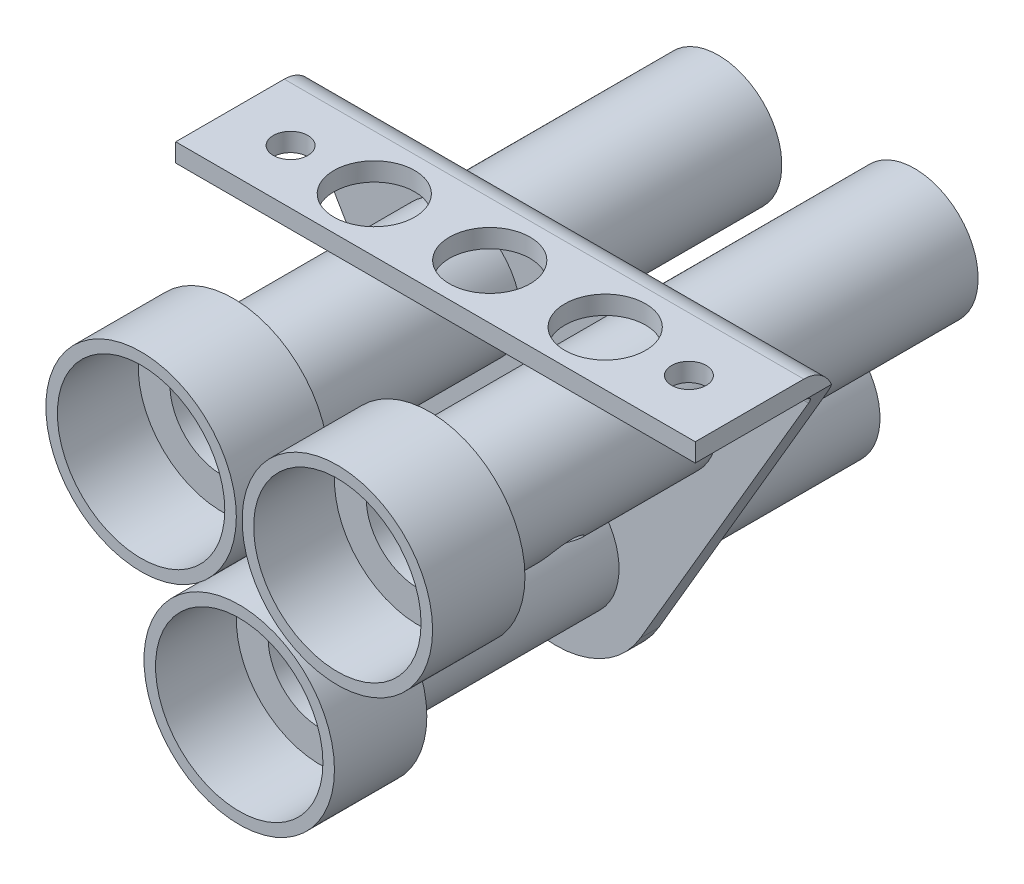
ISO-10303-21;
HEADER;
FILE_DESCRIPTION(('STEP AP214'),'2;1');
FILE_NAME('part.step','',(''),(''),'','','');
FILE_SCHEMA(('AUTOMOTIVE_DESIGN { 1 0 10303 214 1 1 1 1 }'));
ENDSEC;
DATA;
#1=APPLICATION_CONTEXT('core data for automotive mechanical design processes');
#2=APPLICATION_PROTOCOL_DEFINITION('international standard','automotive_design',2000,#1);
#3=PRODUCT_CONTEXT('',#1,'mechanical');
#4=PRODUCT('Part','Part','',(#3));
#5=PRODUCT_RELATED_PRODUCT_CATEGORY('part','',(#4));
#6=PRODUCT_DEFINITION_FORMATION('','',#4);
#7=PRODUCT_DEFINITION_CONTEXT('part definition',#1,'design');
#8=PRODUCT_DEFINITION('design','',#6,#7);
#9=PRODUCT_DEFINITION_SHAPE('','',#8);
#10=(LENGTH_UNIT() NAMED_UNIT(*) SI_UNIT(.MILLI.,.METRE.));
#11=(NAMED_UNIT(*) PLANE_ANGLE_UNIT() SI_UNIT($,.RADIAN.));
#12=(NAMED_UNIT(*) SI_UNIT($,.STERADIAN.) SOLID_ANGLE_UNIT());
#13=UNCERTAINTY_MEASURE_WITH_UNIT(LENGTH_MEASURE(1.E-05),#10,'distance_accuracy_value','');
#14=(GEOMETRIC_REPRESENTATION_CONTEXT(3) GLOBAL_UNCERTAINTY_ASSIGNED_CONTEXT((#13)) GLOBAL_UNIT_ASSIGNED_CONTEXT((#10,
#11,#12)) REPRESENTATION_CONTEXT('',''));
#15=CARTESIAN_POINT('',(0.,0.,0.));
#16=DIRECTION('',(0.,0.,1.));
#17=DIRECTION('',(1.,0.,0.));
#18=AXIS2_PLACEMENT_3D('',#15,#16,#17);
#19=CARTESIAN_POINT('',(8.5,-8.5,42.));
#20=DIRECTION('',(0.,0.,-1.));
#21=DIRECTION('',(-1.,0.,0.));
#22=AXIS2_PLACEMENT_3D('',#19,#20,#21);
#23=CYLINDRICAL_SURFACE('',#22,5.50000000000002);
#24=CARTESIAN_POINT('',(8.5,-8.5,22.6));
#25=DIRECTION('',(0.,0.,-1.));
#26=DIRECTION('',(-1.,0.,0.));
#27=AXIS2_PLACEMENT_3D('',#24,#25,#26);
#28=CIRCLE('',#27,5.50000000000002);
#29=CARTESIAN_POINT('',(2.99999999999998,-8.5,22.6));
#30=VERTEX_POINT('',#29);
#31=EDGE_CURVE('E190',#30,#30,#28,.F.);
#32=ORIENTED_EDGE('',*,*,#31,.T.);
#33=EDGE_LOOP('',(#32));
#34=FACE_BOUND('',#33,.T.);
#35=CARTESIAN_POINT('',(8.5,-8.5,42.));
#36=DIRECTION('',(0.,0.,1.));
#37=DIRECTION('',(1.,0.,0.));
#38=AXIS2_PLACEMENT_3D('',#35,#36,#37);
#39=CIRCLE('',#38,5.50000000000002);
#40=CARTESIAN_POINT('',(14.,-8.5,42.));
#41=VERTEX_POINT('',#40);
#42=EDGE_CURVE('E182',#41,#41,#39,.T.);
#43=ORIENTED_EDGE('',*,*,#42,.F.);
#44=EDGE_LOOP('',(#43));
#45=FACE_BOUND('',#44,.T.);
#46=CARTESIAN_POINT('',(10.2612176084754,-13.7103850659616,34.6));
#47=CARTESIAN_POINT('',(10.2612136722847,-13.7103849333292,34.4917254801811));
#48=CARTESIAN_POINT('',(10.2702058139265,-13.7073723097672,34.3834709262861));
#49=CARTESIAN_POINT('',(10.3055827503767,-13.6952108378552,34.1702098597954));
#50=CARTESIAN_POINT('',(10.3319678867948,-13.6860618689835,34.0652034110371));
#51=CARTESIAN_POINT('',(10.4004920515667,-13.661340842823,33.8615724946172));
#52=CARTESIAN_POINT('',(10.4425953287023,-13.6457833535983,33.7629341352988));
#53=CARTESIAN_POINT('',(10.5404292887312,-13.6077777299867,33.5741091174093));
#54=CARTESIAN_POINT('',(10.5961637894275,-13.5853276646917,33.4839248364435));
#55=CARTESIAN_POINT('',(10.7214833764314,-13.531881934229,33.3103580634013));
#56=CARTESIAN_POINT('',(10.7915558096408,-13.5005640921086,33.2274265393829));
#57=CARTESIAN_POINT('',(10.941119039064,-13.4292792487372,33.0748035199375));
#58=CARTESIAN_POINT('',(11.0206116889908,-13.3893105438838,33.0051146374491));
#59=CARTESIAN_POINT('',(11.1887483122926,-13.2989594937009,32.8788189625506));
#60=CARTESIAN_POINT('',(11.2776026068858,-13.2482869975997,32.822697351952));
#61=CARTESIAN_POINT('',(11.4588659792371,-13.1374963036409,32.7283653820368));
#62=CARTESIAN_POINT('',(11.5512738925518,-13.0773811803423,32.6901492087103));
#63=CARTESIAN_POINT('',(11.7323659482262,-12.9512339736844,32.6342796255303));
#64=CARTESIAN_POINT('',(11.8210482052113,-12.8855433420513,32.6158509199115));
#65=CARTESIAN_POINT('',(11.995391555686,-12.7478887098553,32.5976006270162));
#66=CARTESIAN_POINT('',(12.0810535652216,-12.675926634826,32.5977733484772));
#67=CARTESIAN_POINT('',(12.2427949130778,-12.5314644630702,32.6162580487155));
#68=CARTESIAN_POINT('',(12.3191347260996,-12.459145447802,32.6337250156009));
#69=CARTESIAN_POINT('',(12.4648261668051,-12.3132385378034,32.6848877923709));
#70=CARTESIAN_POINT('',(12.5341773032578,-12.2396505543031,32.7185847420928));
#71=CARTESIAN_POINT('',(12.6656253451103,-12.0926914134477,32.8016711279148));
#72=CARTESIAN_POINT('',(12.7276049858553,-12.0193382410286,32.8512770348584));
#73=CARTESIAN_POINT('',(12.8425161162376,-11.8765318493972,32.9645857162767));
#74=CARTESIAN_POINT('',(12.8954447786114,-11.8070798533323,33.0282928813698));
#75=CARTESIAN_POINT('',(12.9947013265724,-11.6709849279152,33.1721212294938));
#76=CARTESIAN_POINT('',(13.0405020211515,-11.6047099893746,33.2529555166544));
#77=CARTESIAN_POINT('',(13.121806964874,-11.48233313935,33.4266493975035));
#78=CARTESIAN_POINT('',(13.1573089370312,-11.426233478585,33.5195116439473));
#79=CARTESIAN_POINT('',(13.2187463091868,-11.3261216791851,33.7170090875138));
#80=CARTESIAN_POINT('',(13.2444786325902,-11.2823705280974,33.8218407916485));
#81=CARTESIAN_POINT('',(13.2854686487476,-11.2112716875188,34.0388498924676));
#82=CARTESIAN_POINT('',(13.3007317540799,-11.1839155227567,34.1510234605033));
#83=CARTESIAN_POINT('',(13.3203269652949,-11.1485538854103,34.3732358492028));
#84=CARTESIAN_POINT('',(13.3251902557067,-11.139609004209,34.4830782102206));
#85=CARTESIAN_POINT('',(13.32558770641,-11.1388836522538,34.7028227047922));
#86=CARTESIAN_POINT('',(13.3211240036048,-11.1470992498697,34.8127248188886));
#87=CARTESIAN_POINT('',(13.3032634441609,-11.1793600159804,35.0244575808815));
#88=CARTESIAN_POINT('',(13.2902643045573,-11.2026998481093,35.1264312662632));
#89=CARTESIAN_POINT('',(13.2556942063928,-11.2630733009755,35.3247044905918));
#90=CARTESIAN_POINT('',(13.2341215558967,-11.3001096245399,35.4210029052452));
#91=CARTESIAN_POINT('',(13.1813899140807,-11.3874334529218,35.6090407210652));
#92=CARTESIAN_POINT('',(13.1499139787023,-11.4381497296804,35.7004914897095));
#93=CARTESIAN_POINT('',(13.0775501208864,-11.5496634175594,35.8729394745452));
#94=CARTESIAN_POINT('',(13.0366589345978,-11.6104643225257,35.9539330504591));
#95=CARTESIAN_POINT('',(12.9426888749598,-11.7433796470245,36.1081163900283));
#96=CARTESIAN_POINT('',(12.8890335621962,-11.8159497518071,36.1805644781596));
#97=CARTESIAN_POINT('',(12.7712291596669,-11.9663691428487,36.3097845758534));
#98=CARTESIAN_POINT('',(12.7070801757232,-12.0442183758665,36.366556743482));
#99=CARTESIAN_POINT('',(12.5692481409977,-12.2016349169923,36.4623860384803));
#100=CARTESIAN_POINT('',(12.4956100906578,-12.2811927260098,36.501523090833));
#101=CARTESIAN_POINT('',(12.3399713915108,-12.439148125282,36.5609479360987));
#102=CARTESIAN_POINT('',(12.2579744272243,-12.5175462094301,36.5812439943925));
#103=CARTESIAN_POINT('',(12.0925410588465,-12.6659714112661,36.6015598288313));
#104=CARTESIAN_POINT('',(12.0094334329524,-12.7362217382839,36.6026361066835));
#105=CARTESIAN_POINT('',(11.8402060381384,-12.8708938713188,36.5871678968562));
#106=CARTESIAN_POINT('',(11.7540865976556,-12.9353163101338,36.5706253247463));
#107=CARTESIAN_POINT('',(11.5835257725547,-13.0554942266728,36.5211217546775));
#108=CARTESIAN_POINT('',(11.4990887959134,-13.1114082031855,36.488527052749));
#109=CARTESIAN_POINT('',(11.3326734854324,-13.215464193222,36.4082012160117));
#110=CARTESIAN_POINT('',(11.2506956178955,-13.2636047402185,36.3604672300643));
#111=CARTESIAN_POINT('',(11.0885412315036,-13.3537007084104,36.2489937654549));
#112=CARTESIAN_POINT('',(11.0085747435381,-13.3953235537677,36.1846806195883));
#113=CARTESIAN_POINT('',(10.8568608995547,-13.4701483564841,36.0427982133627));
#114=CARTESIAN_POINT('',(10.7851164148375,-13.5033473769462,35.9652243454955));
#115=CARTESIAN_POINT('',(10.6492842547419,-13.5632361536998,35.7945078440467));
#116=CARTESIAN_POINT('',(10.5857420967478,-13.5895285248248,35.7007896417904));
#117=CARTESIAN_POINT('',(10.4736510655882,-13.634038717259,35.5030071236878));
#118=CARTESIAN_POINT('',(10.4251020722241,-13.6522566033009,35.3989428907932));
#119=CARTESIAN_POINT('',(10.3450004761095,-13.681490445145,35.1812552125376));
#120=CARTESIAN_POINT('',(10.3137751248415,-13.6923685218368,35.0674916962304));
#121=CARTESIAN_POINT('',(10.271891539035,-13.706813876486,34.8358093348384));
#122=CARTESIAN_POINT('',(10.2612218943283,-13.7103852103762,34.7178928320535));
#123=CARTESIAN_POINT('',(10.2612176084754,-13.7103850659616,34.6));
#124=B_SPLINE_CURVE_WITH_KNOTS('',3,(#46,#47,#48,#49,#50,#51,#52,#53,#54,#55,#56,#57,#58,#59,
#60,#61,#62,#63,#64,#65,#66,#67,#68,#69,#70,#71,#72,#73,#74,#75,#76,#77,#78,#79,#80,#81,#82,#83,
#84,#85,#86,#87,#88,#89,#90,#91,#92,#93,#94,#95,#96,#97,#98,#99,#100,#101,#102,#103,#104,#105,
#106,#107,#108,#109,#110,#111,#112,#113,#114,#115,#116,#117,#118,#119,#120,#121,#122,#123),
.UNSPECIFIED.,.T.,.F.,(4,2,2,2,2,2,2,2,2,2,2,2,2,2,2,2,2,2,2,2,2,2,2,2,2,2,2,2,2,2,2,2,2,2,2,2,
2,2,4),(0.,0.324385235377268,0.64877684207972,0.972435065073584,1.29618404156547,
1.63366988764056,1.97122225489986,2.31948370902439,2.66763200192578,3.00157681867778,
3.33541946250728,3.65371703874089,3.9720369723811,4.29488638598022,4.61783646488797,
4.95865365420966,5.29954613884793,5.64718022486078,5.99463444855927,6.32387056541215,
6.65303125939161,6.96784950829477,7.28272991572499,7.60893794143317,7.93525921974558,
8.28082051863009,8.6263783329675,8.97035387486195,9.31417844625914,9.63904117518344,
9.96386858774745,10.2816050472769,10.5994013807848,10.9301665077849,11.26104679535,
11.6080968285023,11.9551440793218,12.3085415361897,12.6617427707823),.UNSPECIFIED.);
#125=CARTESIAN_POINT('',(10.2612176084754,-13.7103850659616,34.6));
#126=VERTEX_POINT('',#125);
#127=EDGE_CURVE('E287',#126,#126,#124,.T.);
#128=ORIENTED_EDGE('',*,*,#127,.F.);
#129=EDGE_LOOP('',(#128));
#130=FACE_BOUND('',#129,.T.);
#131=ADVANCED_FACE('F34',(#34,#45,#130),#23,.T.);
#132=CARTESIAN_POINT('',(8.5,-8.5,42.));
#133=DIRECTION('',(0.,0.,-1.));
#134=DIRECTION('',(-1.,0.,0.));
#135=AXIS2_PLACEMENT_3D('',#132,#133,#134);
#136=CYLINDRICAL_SURFACE('',#135,4.50000000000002);
#137=CARTESIAN_POINT('',(8.5,-8.5,43.));
#138=DIRECTION('',(0.,0.,1.));
#139=DIRECTION('',(1.,0.,0.));
#140=AXIS2_PLACEMENT_3D('',#137,#138,#139);
#141=CIRCLE('',#140,4.50000000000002);
#142=CARTESIAN_POINT('',(13.,-8.5,43.));
#143=VERTEX_POINT('',#142);
#144=EDGE_CURVE('E172',#143,#143,#141,.T.);
#145=ORIENTED_EDGE('',*,*,#144,.T.);
#146=EDGE_LOOP('',(#145));
#147=FACE_BOUND('',#146,.T.);
#148=CARTESIAN_POINT('',(8.5,-8.5,0.));
#149=DIRECTION('',(0.,0.,1.));
#150=DIRECTION('',(1.,0.,0.));
#151=AXIS2_PLACEMENT_3D('',#148,#149,#150);
#152=CIRCLE('',#151,4.50000000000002);
#153=CARTESIAN_POINT('',(13.,-8.5,0.));
#154=VERTEX_POINT('',#153);
#155=EDGE_CURVE('E178',#154,#154,#152,.T.);
#156=ORIENTED_EDGE('',*,*,#155,.F.);
#157=EDGE_LOOP('',(#156));
#158=FACE_BOUND('',#157,.T.);
#159=CARTESIAN_POINT('',(9.55907080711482,-12.8735990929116,34.6));
#160=CARTESIAN_POINT('',(9.55907838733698,-12.8736001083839,34.4940960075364));
#161=CARTESIAN_POINT('',(9.56827731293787,-12.8714011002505,34.3880204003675));
#162=CARTESIAN_POINT('',(9.60442198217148,-12.8624054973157,34.1789927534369));
#163=CARTESIAN_POINT('',(9.6314127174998,-12.8555972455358,34.0760493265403));
#164=CARTESIAN_POINT('',(9.70114953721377,-12.8368795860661,33.876686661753));
#165=CARTESIAN_POINT('',(9.74382534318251,-12.8249928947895,33.7802405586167));
#166=CARTESIAN_POINT('',(9.84254343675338,-12.7953723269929,33.5955085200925));
#167=CARTESIAN_POINT('',(9.89858383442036,-12.7776392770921,33.5072214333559));
#168=CARTESIAN_POINT('',(10.0255263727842,-12.7340935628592,33.3349947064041));
#169=CARTESIAN_POINT('',(10.097153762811,-12.7078336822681,33.251702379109));
#170=CARTESIAN_POINT('',(10.2498317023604,-12.6466673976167,33.0978463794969));
#171=CARTESIAN_POINT('',(10.330886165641,-12.6117573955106,33.0272880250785));
#172=CARTESIAN_POINT('',(10.5037461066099,-12.5304545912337,32.8974363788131));
#173=CARTESIAN_POINT('',(10.5958879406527,-12.4835705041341,32.8388929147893));
#174=CARTESIAN_POINT('',(10.7836694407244,-12.3789658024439,32.7398668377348));
#175=CARTESIAN_POINT('',(10.8793073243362,-12.3212506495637,32.6993751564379));
#176=CARTESIAN_POINT('',(11.0646427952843,-12.1992148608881,32.6400153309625));
#177=CARTESIAN_POINT('',(11.1543619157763,-12.1354747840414,32.6200250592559));
#178=CARTESIAN_POINT('',(11.330163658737,-12.0003488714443,32.5985876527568));
#179=CARTESIAN_POINT('',(11.4162479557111,-11.9289666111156,32.5971318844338));
#180=CARTESIAN_POINT('',(11.5761487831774,-11.7860342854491,32.6122649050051));
#181=CARTESIAN_POINT('',(11.6504019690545,-11.7148363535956,32.6276142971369));
#182=CARTESIAN_POINT('',(11.7915249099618,-11.5701917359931,32.6737682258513));
#183=CARTESIAN_POINT('',(11.8583941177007,-11.4967448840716,32.704573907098));
#184=CARTESIAN_POINT('',(11.9846538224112,-11.3489969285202,32.7810974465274));
#185=CARTESIAN_POINT('',(12.0439147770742,-11.2746998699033,32.8270354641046));
#186=CARTESIAN_POINT('',(12.1533498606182,-11.1289453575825,32.9322837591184));
#187=CARTESIAN_POINT('',(12.2035206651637,-11.0574889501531,32.991598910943));
#188=CARTESIAN_POINT('',(12.2984262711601,-10.9145161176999,33.1273187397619));
#189=CARTESIAN_POINT('',(12.3424239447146,-10.843436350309,33.2047001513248));
#190=CARTESIAN_POINT('',(12.420353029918,-10.7106051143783,33.3716533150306));
#191=CARTESIAN_POINT('',(12.4542794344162,-10.6488582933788,33.4612310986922));
#192=CARTESIAN_POINT('',(12.513800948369,-10.5356013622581,33.6546954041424));
#193=CARTESIAN_POINT('',(12.5389900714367,-10.4846249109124,33.7590225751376));
#194=CARTESIAN_POINT('',(12.5795091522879,-10.3999561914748,33.9762433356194));
#195=CARTESIAN_POINT('',(12.5948472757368,-10.3662496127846,34.089129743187));
#196=CARTESIAN_POINT('',(12.6152791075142,-10.3207311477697,34.3117707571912));
#197=CARTESIAN_POINT('',(12.621020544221,-10.3075395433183,34.421182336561));
#198=CARTESIAN_POINT('',(12.6244108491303,-10.2997948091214,34.6407678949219));
#199=CARTESIAN_POINT('',(12.6220632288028,-10.3052335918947,34.7509415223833));
#200=CARTESIAN_POINT('',(12.6097379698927,-10.3330976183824,34.9599260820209));
#201=CARTESIAN_POINT('',(12.6003635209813,-10.354178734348,35.0589574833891));
#202=CARTESIAN_POINT('',(12.5745446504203,-10.4102437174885,35.2520241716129));
#203=CARTESIAN_POINT('',(12.5580984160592,-10.4452311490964,35.3460581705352));
#204=CARTESIAN_POINT('',(12.5169696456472,-10.5288447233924,35.531183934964));
#205=CARTESIAN_POINT('',(12.4919514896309,-10.5780111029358,35.6219557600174));
#206=CARTESIAN_POINT('',(12.4335008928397,-10.686634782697,35.7941636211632));
#207=CARTESIAN_POINT('',(12.4000644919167,-10.7460969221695,35.8755952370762));
#208=CARTESIAN_POINT('',(12.3207330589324,-10.8787633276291,36.0348780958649));
#209=CARTESIAN_POINT('',(12.2739562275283,-10.9527364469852,36.1116543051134));
#210=CARTESIAN_POINT('',(12.1693614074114,-11.1066135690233,36.2503639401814));
#211=CARTESIAN_POINT('',(12.1115418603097,-11.1865184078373,36.3122952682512));
#212=CARTESIAN_POINT('',(11.9843464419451,-11.3495785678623,36.4198434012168));
#213=CARTESIAN_POINT('',(11.9148760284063,-11.4327558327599,36.4653162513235));
#214=CARTESIAN_POINT('',(11.7656376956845,-11.5980597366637,36.537291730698));
#215=CARTESIAN_POINT('',(11.6858768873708,-11.6801870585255,36.563807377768));
#216=CARTESIAN_POINT('',(11.5245740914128,-11.8336733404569,36.5953168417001));
#217=CARTESIAN_POINT('',(11.4436500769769,-11.9053734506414,36.601820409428));
#218=CARTESIAN_POINT('',(11.2771203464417,-12.042488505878,36.5973051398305));
#219=CARTESIAN_POINT('',(11.1915156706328,-12.1079048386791,36.5862901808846));
#220=CARTESIAN_POINT('',(11.0223571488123,-12.2280034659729,36.5481275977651));
#221=CARTESIAN_POINT('',(10.9388808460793,-12.2830332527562,36.5217174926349));
#222=CARTESIAN_POINT('',(10.7728877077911,-12.3850328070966,36.454376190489));
#223=CARTESIAN_POINT('',(10.6903710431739,-12.432001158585,36.4134424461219));
#224=CARTESIAN_POINT('',(10.5251095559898,-12.5197119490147,36.3161514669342));
#225=CARTESIAN_POINT('',(10.4425276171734,-12.5600703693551,36.2591733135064));
#226=CARTESIAN_POINT('',(10.2838301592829,-12.6322588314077,36.1322660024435));
#227=CARTESIAN_POINT('',(10.207717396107,-12.6640852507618,36.0623313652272));
#228=CARTESIAN_POINT('',(10.0588969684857,-12.7221694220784,35.9050352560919));
#229=CARTESIAN_POINT('',(9.98692989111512,-12.7477909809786,35.8167349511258));
#230=CARTESIAN_POINT('',(9.85676620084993,-12.7911429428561,35.628651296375));
#231=CARTESIAN_POINT('',(9.79857819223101,-12.8088684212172,35.5288608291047));
#232=CARTESIAN_POINT('',(9.69915845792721,-12.8375939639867,35.3197445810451));
#233=CARTESIAN_POINT('',(9.65799266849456,-12.8485679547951,35.2103836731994));
#234=CARTESIAN_POINT('',(9.59610898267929,-12.8645844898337,34.9858092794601));
#235=CARTESIAN_POINT('',(9.57532247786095,-12.8696469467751,34.8706168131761));
#236=CARTESIAN_POINT('',(9.5634009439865,-12.8725480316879,34.728943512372));
#237=CARTESIAN_POINT('',(9.56177931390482,-12.872942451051,34.7031862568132));
#238=CARTESIAN_POINT('',(9.55961330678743,-12.8734678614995,34.6516227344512));
#239=CARTESIAN_POINT('',(9.55906895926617,-12.8735988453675,34.6258164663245));
#240=CARTESIAN_POINT('',(9.55907080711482,-12.8735990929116,34.6));
#241=B_SPLINE_CURVE_WITH_KNOTS('',3,(#159,#160,#161,#162,#163,#164,#165,#166,#167,#168,#169,
#170,#171,#172,#173,#174,#175,#176,#177,#178,#179,#180,#181,#182,#183,#184,#185,#186,#187,#188,
#189,#190,#191,#192,#193,#194,#195,#196,#197,#198,#199,#200,#201,#202,#203,#204,#205,#206,#207,
#208,#209,#210,#211,#212,#213,#214,#215,#216,#217,#218,#219,#220,#221,#222,#223,#224,#225,#226,
#227,#228,#229,#230,#231,#232,#233,#234,#235,#236,#237,#238,#239,#240),.UNSPECIFIED.,.T.,.F.,(4,
2,2,2,2,2,2,2,2,2,2,2,2,2,2,2,2,2,2,2,2,2,2,2,2,2,2,2,2,2,2,2,2,2,2,2,2,2,2,2,4),(0.,
0.317603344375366,0.636012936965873,0.953012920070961,1.26996810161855,1.60735896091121,
1.9448903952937,2.29948552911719,2.65390233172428,2.98767546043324,3.3212931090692,
3.63186770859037,3.94246531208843,4.25779759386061,4.57324496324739,4.9134842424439,
5.25389239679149,5.60848267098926,5.96277863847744,6.29202080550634,6.62112006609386,
6.92480624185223,7.22857030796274,7.54592692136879,7.86343310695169,8.21110201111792,
8.55882001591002,8.90950977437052,9.25995848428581,9.58322590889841,9.90642177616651,
10.2152769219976,10.5241862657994,10.8472538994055,11.1704584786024,11.5191241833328,
11.8680070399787,12.2182289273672,12.5672676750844,12.6446884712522,12.7221113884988),.UNSPECIFIED.);
#242=CARTESIAN_POINT('',(9.55907080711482,-12.8735990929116,34.6));
#243=VERTEX_POINT('',#242);
#244=EDGE_CURVE('E281',#243,#243,#241,.T.);
#245=ORIENTED_EDGE('',*,*,#244,.T.);
#246=EDGE_LOOP('',(#245));
#247=FACE_BOUND('',#246,.T.);
#248=ADVANCED_FACE('F289',(#147,#158,#247),#136,.F.);
#249=CARTESIAN_POINT('',(-8.5,-8.5,42.));
#250=DIRECTION('',(0.,0.,-1.));
#251=DIRECTION('',(-1.,0.,0.));
#252=AXIS2_PLACEMENT_3D('',#249,#250,#251);
#253=CYLINDRICAL_SURFACE('',#252,5.50000000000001);
#254=CARTESIAN_POINT('',(-13.3253953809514,-11.1392346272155,34.6));
#255=CARTESIAN_POINT('',(-13.3253959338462,-11.139230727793,34.7082745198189));
#256=CARTESIAN_POINT('',(-13.320867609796,-11.1475631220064,34.8165290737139));
#257=CARTESIAN_POINT('',(-13.3027477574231,-11.1802907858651,35.0297901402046));
#258=CARTESIAN_POINT('',(-13.2891560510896,-11.2046863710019,35.1347965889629));
#259=CARTESIAN_POINT('',(-13.2529114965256,-11.2678767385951,35.3384275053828));
#260=CARTESIAN_POINT('',(-13.2302792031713,-11.3066388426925,35.4370658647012));
#261=CARTESIAN_POINT('',(-13.1758622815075,-11.3963868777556,35.6258908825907));
#262=CARTESIAN_POINT('',(-13.1440750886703,-11.4473762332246,35.7160751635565));
#263=CARTESIAN_POINT('',(-13.0696798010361,-11.5615111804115,35.8896419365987));
#264=CARTESIAN_POINT('',(-13.0266697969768,-11.6250807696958,35.9725734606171));
#265=CARTESIAN_POINT('',(-12.930496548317,-11.7599933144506,36.1251964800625));
#266=CARTESIAN_POINT('',(-12.8773313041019,-11.8313377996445,36.1948853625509));
#267=CARTESIAN_POINT('',(-12.7591562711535,-11.9812307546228,36.3211810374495));
#268=CARTESIAN_POINT('',(-12.6938242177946,-12.0599359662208,36.377302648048));
#269=CARTESIAN_POINT('',(-12.5532406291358,-12.2192069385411,36.4716346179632));
#270=CARTESIAN_POINT('',(-12.477992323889,-12.2997720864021,36.5098507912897));
#271=CARTESIAN_POINT('',(-12.3223152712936,-12.4562077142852,36.5657203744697));
#272=CARTESIAN_POINT('',(-12.2422231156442,-12.532135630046,36.5841490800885));
#273=CARTESIAN_POINT('',(-12.0763853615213,-12.6799268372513,36.6023993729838));
#274=CARTESIAN_POINT('',(-11.9906415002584,-12.7517913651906,36.6022266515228));
#275=CARTESIAN_POINT('',(-11.8202879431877,-12.8859899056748,36.5837419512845));
#276=CARTESIAN_POINT('',(-11.7358113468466,-12.9486118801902,36.5662749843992));
#277=CARTESIAN_POINT('',(-11.5668220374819,-13.0667534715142,36.5151122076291));
#278=CARTESIAN_POINT('',(-11.4823093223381,-13.1222725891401,36.4814152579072));
#279=CARTESIAN_POINT('',(-11.3147571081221,-13.2262044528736,36.3983288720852));
#280=CARTESIAN_POINT('',(-11.2317556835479,-13.2745048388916,36.3487229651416));
#281=CARTESIAN_POINT('',(-11.0711647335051,-13.3628721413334,36.2354142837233));
#282=CARTESIAN_POINT('',(-10.9935769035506,-13.4029364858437,36.1717071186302));
#283=CARTESIAN_POINT('',(-10.8423138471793,-13.4770524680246,36.0278787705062));
#284=CARTESIAN_POINT('',(-10.7690925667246,-13.5106488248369,35.9470444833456));
#285=CARTESIAN_POINT('',(-10.6344564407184,-13.5694680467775,35.7733506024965));
#286=CARTESIAN_POINT('',(-10.573044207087,-13.5946890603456,35.6804883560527));
#287=CARTESIAN_POINT('',(-10.4637848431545,-13.6378088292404,35.4829909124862));
#288=CARTESIAN_POINT('',(-10.416229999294,-13.6555529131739,35.3781592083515));
#289=CARTESIAN_POINT('',(-10.3390934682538,-13.6835740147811,35.1611501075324));
#290=CARTESIAN_POINT('',(-10.3095024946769,-13.6938548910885,35.0489765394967));
#291=CARTESIAN_POINT('',(-10.2712754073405,-13.7070119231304,34.8267641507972));
#292=CARTESIAN_POINT('',(-10.2616219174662,-13.7102480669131,34.7169217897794));
#293=CARTESIAN_POINT('',(-10.2608385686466,-13.7105135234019,34.4971772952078));
#294=CARTESIAN_POINT('',(-10.2697044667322,-13.7075442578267,34.3872751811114));
#295=CARTESIAN_POINT('',(-10.3045765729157,-13.6955570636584,34.1755424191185));
#296=CARTESIAN_POINT('',(-10.3298190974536,-13.6868083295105,34.0735687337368));
#297=CARTESIAN_POINT('',(-10.3952783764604,-13.6632471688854,33.8752955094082));
#298=CARTESIAN_POINT('',(-10.4354980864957,-13.6484335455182,33.7789970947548));
#299=CARTESIAN_POINT('',(-10.5306520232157,-13.6116666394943,33.5909592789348));
#300=CARTESIAN_POINT('',(-10.5860635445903,-13.5894756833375,33.4995085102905));
#301=CARTESIAN_POINT('',(-10.7084489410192,-13.5375753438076,33.3270605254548));
#302=CARTESIAN_POINT('',(-10.7754268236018,-13.5078633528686,33.2460669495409));
#303=CARTESIAN_POINT('',(-10.9226405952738,-13.4384014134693,33.0918836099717));
#304=CARTESIAN_POINT('',(-11.0034253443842,-13.398162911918,33.0194355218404));
#305=CARTESIAN_POINT('',(-11.1720160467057,-13.3082682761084,32.8902154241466));
#306=CARTESIAN_POINT('',(-11.2598219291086,-13.258612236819,32.833443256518));
#307=CARTESIAN_POINT('',(-11.4387812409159,-13.1502092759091,32.7376139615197));
#308=CARTESIAN_POINT('',(-11.5299175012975,-13.0915050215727,32.698476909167));
#309=CARTESIAN_POINT('',(-11.7124995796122,-12.9656594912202,32.6390520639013));
#310=CARTESIAN_POINT('',(-11.8039452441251,-12.8985219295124,32.6187560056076));
#311=CARTESIAN_POINT('',(-11.9788427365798,-12.7613756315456,32.5984401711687));
#312=CARTESIAN_POINT('',(-12.0624572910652,-12.6917294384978,32.5973638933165));
#313=CARTESIAN_POINT('',(-12.2244694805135,-12.5484585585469,32.6128321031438));
#314=CARTESIAN_POINT('',(-12.302867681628,-12.4748343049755,32.6293746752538));
#315=CARTESIAN_POINT('',(-12.4508374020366,-12.3277333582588,32.6788782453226));
#316=CARTESIAN_POINT('',(-12.5205642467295,-12.2542885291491,32.711472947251));
#317=CARTESIAN_POINT('',(-12.6519371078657,-12.1084705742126,32.7917987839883));
#318=CARTESIAN_POINT('',(-12.7135815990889,-12.0360976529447,32.8395327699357));
#319=CARTESIAN_POINT('',(-12.8304666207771,-11.8920517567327,32.9510062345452));
#320=CARTESIAN_POINT('',(-12.8853431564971,-11.8205278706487,33.0153193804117));
#321=CARTESIAN_POINT('',(-12.9853760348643,-11.6841120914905,33.1572017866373));
#322=CARTESIAN_POINT('',(-13.0305289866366,-11.6192225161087,33.2347756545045));
#323=CARTESIAN_POINT('',(-13.1130949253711,-11.4958535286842,33.4054921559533));
#324=CARTESIAN_POINT('',(-13.1500218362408,-11.4378423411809,33.4992103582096));
#325=CARTESIAN_POINT('',(-13.2133202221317,-11.3351833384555,33.6969928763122));
#326=CARTESIAN_POINT('',(-13.2396917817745,-11.2905354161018,33.8010571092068));
#327=CARTESIAN_POINT('',(-13.2823909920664,-11.2167271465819,34.0187447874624));
#328=CARTESIAN_POINT('',(-13.2985260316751,-11.1878651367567,34.1325083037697));
#329=CARTESIAN_POINT('',(-13.320024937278,-11.1491262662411,34.3641906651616));
#330=CARTESIAN_POINT('',(-13.3253947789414,-11.139238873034,34.4821071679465));
#331=CARTESIAN_POINT('',(-13.3253953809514,-11.1392346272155,34.6));
#332=B_SPLINE_CURVE_WITH_KNOTS('',3,(#254,#255,#256,#257,#258,#259,#260,#261,#262,#263,#264,
#265,#266,#267,#268,#269,#270,#271,#272,#273,#274,#275,#276,#277,#278,#279,#280,#281,#282,#283,
#284,#285,#286,#287,#288,#289,#290,#291,#292,#293,#294,#295,#296,#297,#298,#299,#300,#301,#302,
#303,#304,#305,#306,#307,#308,#309,#310,#311,#312,#313,#314,#315,#316,#317,#318,#319,#320,#321,
#322,#323,#324,#325,#326,#327,#328,#329,#330,#331),.UNSPECIFIED.,.T.,.F.,(4,2,2,2,2,2,2,2,2,2,2,
2,2,2,2,2,2,2,2,2,2,2,2,2,2,2,2,2,2,2,2,2,2,2,2,2,2,2,4),(0.,0.324385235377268,0.64877684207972,
0.972435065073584,1.29618404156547,1.63366988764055,1.97122225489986,2.31948370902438,
2.66763200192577,3.00157681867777,3.33541946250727,3.65371703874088,3.97203697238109,
4.29488638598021,4.61783646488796,4.95865365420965,5.29954613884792,5.64718022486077,
5.99463444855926,6.32387056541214,6.6530312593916,6.96784950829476,7.28272991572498,
7.60893794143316,7.93525921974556,8.28082051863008,8.62637833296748,8.97035387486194,
9.31417844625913,9.63904117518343,9.96386858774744,10.2816050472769,10.5994013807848,
10.9301665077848,11.26104679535,11.6080968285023,11.9551440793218,12.3085415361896,
12.6617427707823),.UNSPECIFIED.);
#333=CARTESIAN_POINT('',(-13.3253953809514,-11.1392346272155,34.6));
#334=VERTEX_POINT('',#333);
#335=EDGE_CURVE('E288',#334,#334,#332,.T.);
#336=ORIENTED_EDGE('',*,*,#335,.T.);
#337=EDGE_LOOP('',(#336));
#338=FACE_BOUND('',#337,.T.);
#339=CARTESIAN_POINT('',(-8.5,-8.5,42.));
#340=DIRECTION('',(0.,0.,1.));
#341=DIRECTION('',(1.,0.,0.));
#342=AXIS2_PLACEMENT_3D('',#339,#340,#341);
#343=CIRCLE('',#342,5.50000000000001);
#344=CARTESIAN_POINT('',(-3.,-8.5,42.));
#345=VERTEX_POINT('',#344);
#346=EDGE_CURVE('E253',#345,#345,#343,.T.);
#347=ORIENTED_EDGE('',*,*,#346,.F.);
#348=EDGE_LOOP('',(#347));
#349=FACE_BOUND('',#348,.T.);
#350=CARTESIAN_POINT('',(-8.5,-8.5,22.6));
#351=DIRECTION('',(0.,0.,-1.));
#352=DIRECTION('',(-1.,0.,0.));
#353=AXIS2_PLACEMENT_3D('',#350,#351,#352);
#354=CIRCLE('',#353,5.50000000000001);
#355=CARTESIAN_POINT('',(-14.,-8.5,22.6));
#356=VERTEX_POINT('',#355);
#357=EDGE_CURVE('E261',#356,#356,#354,.T.);
#358=ORIENTED_EDGE('',*,*,#357,.F.);
#359=EDGE_LOOP('',(#358));
#360=FACE_BOUND('',#359,.T.);
#361=ADVANCED_FACE('F384',(#338,#349,#360),#253,.T.);
#362=CARTESIAN_POINT('',(-8.5,-8.5,0.));
#363=DIRECTION('',(0.,0.,1.));
#364=DIRECTION('',(1.,0.,0.));
#365=AXIS2_PLACEMENT_3D('',#362,#363,#364);
#366=PLANE('',#365);
#367=CARTESIAN_POINT('',(-8.5,-8.5,0.));
#368=DIRECTION('',(0.,0.,1.));
#369=DIRECTION('',(1.,0.,0.));
#370=AXIS2_PLACEMENT_3D('',#367,#368,#369);
#371=CIRCLE('',#370,5.50000000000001);
#372=CARTESIAN_POINT('',(-14.,-8.5,0.));
#373=VERTEX_POINT('',#372);
#374=EDGE_CURVE('E252',#373,#373,#371,.T.);
#375=ORIENTED_EDGE('',*,*,#374,.F.);
#376=EDGE_LOOP('',(#375));
#377=FACE_BOUND('',#376,.T.);
#378=CARTESIAN_POINT('',(-8.5,-8.5,0.));
#379=DIRECTION('',(0.,0.,1.));
#380=DIRECTION('',(1.,0.,0.));
#381=AXIS2_PLACEMENT_3D('',#378,#379,#380);
#382=CIRCLE('',#381,4.5);
#383=CARTESIAN_POINT('',(-4.,-8.5,0.));
#384=VERTEX_POINT('',#383);
#385=EDGE_CURVE('E249',#384,#384,#382,.T.);
#386=ORIENTED_EDGE('',*,*,#385,.T.);
#387=EDGE_LOOP('',(#386));
#388=FACE_BOUND('',#387,.T.);
#389=ADVANCED_FACE('F382',(#377,#388),#366,.F.);
#390=CARTESIAN_POINT('',(-8.5,-8.5,21.));
#391=DIRECTION('',(0.,0.,-1.));
#392=DIRECTION('',(-1.,0.,0.));
#393=AXIS2_PLACEMENT_3D('',#390,#391,#392);
#394=CIRCLE('',#393,5.50000000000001);
#395=CARTESIAN_POINT('',(-14.,-8.5,21.));
#396=VERTEX_POINT('',#395);
#397=EDGE_CURVE('E196',#396,#396,#394,.T.);
#398=CARTESIAN_POINT('',(-14.,-8.5,21.));
#399=CARTESIAN_POINT('',(-14.,-8.5,20.78125));
#400=CARTESIAN_POINT('',(-14.,-8.5,20.5625));
#401=CARTESIAN_POINT('',(-14.,-8.5,20.125));
#402=CARTESIAN_POINT('',(-14.,-8.5,19.90625));
#403=CARTESIAN_POINT('',(-14.,-8.5,19.46875));
#404=CARTESIAN_POINT('',(-14.,-8.5,19.25));
#405=CARTESIAN_POINT('',(-14.,-8.5,18.8125));
#406=CARTESIAN_POINT('',(-14.,-8.5,18.59375));
#407=CARTESIAN_POINT('',(-14.,-8.5,18.15625));
#408=CARTESIAN_POINT('',(-14.,-8.5,17.9375));
#409=CARTESIAN_POINT('',(-14.,-8.5,17.5));
#410=CARTESIAN_POINT('',(-14.,-8.5,17.28125));
#411=CARTESIAN_POINT('',(-14.,-8.5,16.84375));
#412=CARTESIAN_POINT('',(-14.,-8.5,16.625));
#413=CARTESIAN_POINT('',(-14.,-8.5,16.1875));
#414=CARTESIAN_POINT('',(-14.,-8.5,15.96875));
#415=CARTESIAN_POINT('',(-14.,-8.5,15.53125));
#416=CARTESIAN_POINT('',(-14.,-8.5,15.3125));
#417=CARTESIAN_POINT('',(-14.,-8.5,14.875));
#418=CARTESIAN_POINT('',(-14.,-8.5,14.65625));
#419=CARTESIAN_POINT('',(-14.,-8.5,14.21875));
#420=CARTESIAN_POINT('',(-14.,-8.5,14.));
#421=CARTESIAN_POINT('',(-14.,-8.5,13.5625));
#422=CARTESIAN_POINT('',(-14.,-8.5,13.34375));
#423=CARTESIAN_POINT('',(-14.,-8.5,12.90625));
#424=CARTESIAN_POINT('',(-14.,-8.5,12.6875));
#425=CARTESIAN_POINT('',(-14.,-8.5,12.25));
#426=CARTESIAN_POINT('',(-14.,-8.5,12.03125));
#427=CARTESIAN_POINT('',(-14.,-8.5,11.59375));
#428=CARTESIAN_POINT('',(-14.,-8.5,11.375));
#429=CARTESIAN_POINT('',(-14.,-8.5,10.9375));
#430=CARTESIAN_POINT('',(-14.,-8.5,10.71875));
#431=CARTESIAN_POINT('',(-14.,-8.5,10.28125));
#432=CARTESIAN_POINT('',(-14.,-8.5,10.0625));
#433=CARTESIAN_POINT('',(-14.,-8.5,9.625));
#434=CARTESIAN_POINT('',(-14.,-8.5,9.40625));
#435=CARTESIAN_POINT('',(-14.,-8.5,8.96875));
#436=CARTESIAN_POINT('',(-14.,-8.5,8.75));
#437=CARTESIAN_POINT('',(-14.,-8.5,8.3125));
#438=CARTESIAN_POINT('',(-14.,-8.5,8.09375));
#439=CARTESIAN_POINT('',(-14.,-8.5,7.65625));
#440=CARTESIAN_POINT('',(-14.,-8.5,7.4375));
#441=CARTESIAN_POINT('',(-14.,-8.5,7.));
#442=CARTESIAN_POINT('',(-14.,-8.5,6.78125));
#443=CARTESIAN_POINT('',(-14.,-8.5,6.34375));
#444=CARTESIAN_POINT('',(-14.,-8.5,6.125));
#445=CARTESIAN_POINT('',(-14.,-8.5,5.6875));
#446=CARTESIAN_POINT('',(-14.,-8.5,5.46875));
#447=CARTESIAN_POINT('',(-14.,-8.5,5.03125));
#448=CARTESIAN_POINT('',(-14.,-8.5,4.8125));
#449=CARTESIAN_POINT('',(-14.,-8.5,4.375));
#450=CARTESIAN_POINT('',(-14.,-8.5,4.15625));
#451=CARTESIAN_POINT('',(-14.,-8.5,3.71875));
#452=CARTESIAN_POINT('',(-14.,-8.5,3.5));
#453=CARTESIAN_POINT('',(-14.,-8.5,3.0625));
#454=CARTESIAN_POINT('',(-14.,-8.5,2.84375));
#455=CARTESIAN_POINT('',(-14.,-8.5,2.40625));
#456=CARTESIAN_POINT('',(-14.,-8.5,2.1875));
#457=CARTESIAN_POINT('',(-14.,-8.5,1.75));
#458=CARTESIAN_POINT('',(-14.,-8.5,1.53125));
#459=CARTESIAN_POINT('',(-14.,-8.5,1.09375));
#460=CARTESIAN_POINT('',(-14.,-8.5,0.874999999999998));
#461=CARTESIAN_POINT('',(-14.,-8.5,0.437499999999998));
#462=CARTESIAN_POINT('',(-14.,-8.5,0.218749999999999));
#463=CARTESIAN_POINT('',(-14.,-8.5,0.));
#464=B_SPLINE_CURVE_WITH_KNOTS('',3,(#398,#399,#400,#401,#402,#403,#404,#405,#406,#407,#408,
#409,#410,#411,#412,#413,#414,#415,#416,#417,#418,#419,#420,#421,#422,#423,#424,#425,#426,#427,
#428,#429,#430,#431,#432,#433,#434,#435,#436,#437,#438,#439,#440,#441,#442,#443,#444,#445,#446,
#447,#448,#449,#450,#451,#452,#453,#454,#455,#456,#457,#458,#459,#460,#461,#462,#463),
.UNSPECIFIED.,.F.,.F.,(4,2,2,2,2,2,2,2,2,2,2,2,2,2,2,2,2,2,2,2,2,2,2,2,2,2,2,2,2,2,2,2,4),(0.,
0.656250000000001,1.3125,1.96875,2.625,3.28125,3.9375,4.59375,5.25,5.90625,6.5625,7.21875,7.875,
8.53125,9.1875,9.84375,10.5,11.15625,11.8125,12.46875,13.125,13.78125,14.4375,15.09375,15.75,
16.40625,17.0625,17.71875,18.375,19.03125,19.6875,20.34375,21.),.UNSPECIFIED.);
#465=EDGE_CURVE('BSEAM380',#396,#373,#464,.T.);
#466=ORIENTED_EDGE('',*,*,#397,.T.);
#467=ORIENTED_EDGE('',*,*,#374,.T.);
#468=ORIENTED_EDGE('',*,*,#465,.T.);
#469=ORIENTED_EDGE('',*,*,#465,.F.);
#470=EDGE_LOOP('',(#466,#468,#467,#469));
#471=FACE_BOUND('',#470,.T.);
#472=ADVANCED_FACE('F380',(#471),#253,.T.);
#473=CARTESIAN_POINT('',(-8.5,-8.5,42.));
#474=DIRECTION('',(0.,0.,-1.));
#475=DIRECTION('',(-1.,0.,0.));
#476=AXIS2_PLACEMENT_3D('',#473,#474,#475);
#477=CYLINDRICAL_SURFACE('',#476,4.5);
#478=CARTESIAN_POINT('',(-12.6232485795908,-10.3024486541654,34.6));
#479=CARTESIAN_POINT('',(-12.623248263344,-10.3024562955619,34.7059039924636));
#480=CARTESIAN_POINT('',(-12.6194852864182,-10.311133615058,34.8119795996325));
#481=CARTESIAN_POINT('',(-12.6043498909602,-10.3451670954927,35.0210072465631));
#482=CARTESIAN_POINT('',(-12.5929581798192,-10.3705655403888,35.1239506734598));
#483=CARTESIAN_POINT('',(-12.5624152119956,-10.4359926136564,35.323313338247));
#484=CARTESIAN_POINT('',(-12.5432985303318,-10.4759559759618,35.4197594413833));
#485=CARTESIAN_POINT('',(-12.4969857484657,-10.5680307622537,35.6044914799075));
#486=CARTESIAN_POINT('',(-12.4697907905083,-10.6201404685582,35.6927785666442));
#487=CARTESIAN_POINT('',(-12.404863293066,-10.7375928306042,35.8650052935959));
#488=CARTESIAN_POINT('',(-12.3665643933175,-10.8035720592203,35.948297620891));
#489=CARTESIAN_POINT('',(-12.2798151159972,-10.9433090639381,36.1021536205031));
#490=CARTESIAN_POINT('',(-12.231360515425,-11.017070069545,36.1727119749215));
#491=CARTESIAN_POINT('',(-12.1212760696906,-11.1731857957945,36.3025636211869));
#492=CARTESIAN_POINT('',(-12.0591039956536,-11.2557864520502,36.3611070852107));
#493=CARTESIAN_POINT('',(-11.9234805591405,-11.4225507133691,36.4601331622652));
#494=CARTESIAN_POINT('',(-11.8500348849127,-11.5067135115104,36.5006248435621));
#495=CARTESIAN_POINT('',(-11.6976699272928,-11.6680420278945,36.5599846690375));
#496=CARTESIAN_POINT('',(-11.6193186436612,-11.7453297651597,36.5799749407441));
#497=CARTESIAN_POINT('',(-11.455717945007,-11.8949963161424,36.6014123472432));
#498=CARTESIAN_POINT('',(-11.3704717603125,-11.9673773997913,36.6028681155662));
#499=CARTESIAN_POINT('',(-11.2019444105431,-12.1000290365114,36.5877350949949));
#500=CARTESIAN_POINT('',(-11.1189342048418,-12.1607907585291,36.5723857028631));
#501=CARTESIAN_POINT('',(-10.9519813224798,-12.2746524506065,36.5262317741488));
#502=CARTESIAN_POINT('',(-10.8680385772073,-12.327751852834,36.495426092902));
#503=CARTESIAN_POINT('',(-10.7006104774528,-12.4264372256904,36.4189025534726));
#504=CARTESIAN_POINT('',(-10.6171516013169,-12.4718963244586,36.3729645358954));
#505=CARTESIAN_POINT('',(-10.4546082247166,-12.554358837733,36.2677162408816));
#506=CARTESIAN_POINT('',(-10.3755253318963,-12.5913591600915,36.208401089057));
#507=CARTESIAN_POINT('',(-10.2182443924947,-12.6599959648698,36.0726812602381));
#508=CARTESIAN_POINT('',(-10.1406043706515,-12.6909823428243,35.9952998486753));
#509=CARTESIAN_POINT('',(-9.99625889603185,-12.7446616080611,35.8283466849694));
#510=CARTESIAN_POINT('',(-9.92955888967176,-12.7673503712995,35.7387689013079));
#511=CARTESIAN_POINT('',(-9.80768678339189,-12.806300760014,35.5453045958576));
#512=CARTESIAN_POINT('',(-9.75311073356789,-12.8222552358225,35.4409774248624));
#513=CARTESIAN_POINT('',(-9.66269225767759,-12.847456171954,35.2237566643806));
#514=CARTESIAN_POINT('',(-9.6268343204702,-12.8567081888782,35.1108702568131));
#515=CARTESIAN_POINT('',(-9.57845943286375,-12.8689254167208,34.8882292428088));
#516=CARTESIAN_POINT('',(-9.56447124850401,-12.8722889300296,34.778817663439));
#517=CARTESIAN_POINT('',(-9.55625545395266,-12.8742828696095,34.5592321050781));
#518=CARTESIAN_POINT('',(-9.56201926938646,-12.8729153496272,34.4490584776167));
#519=CARTESIAN_POINT('',(-9.59160023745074,-12.8656158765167,34.2400739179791));
#520=CARTESIAN_POINT('',(-9.61398893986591,-12.8600445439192,34.1410425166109));
#521=CARTESIAN_POINT('',(-9.67368556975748,-12.8443535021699,33.9479758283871));
#522=CARTESIAN_POINT('',(-9.71099732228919,-12.8342326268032,33.8539418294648));
#523=CARTESIAN_POINT('',(-9.80048255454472,-12.8082480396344,33.668816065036));
#524=CARTESIAN_POINT('',(-9.85324634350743,-12.7921476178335,33.5780442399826));
#525=CARTESIAN_POINT('',(-9.97036962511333,-12.7534473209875,33.4058363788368));
#526=CARTESIAN_POINT('',(-10.0347345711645,-12.7308443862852,33.3244047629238));
#527=CARTESIAN_POINT('',(-10.1791612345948,-12.6757554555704,33.1651219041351));
#528=CARTESIAN_POINT('',(-10.2601332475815,-12.6425345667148,33.0883456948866));
#529=CARTESIAN_POINT('',(-10.4298353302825,-12.5662492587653,32.9496360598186));
#530=CARTESIAN_POINT('',(-10.5185664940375,-12.5231834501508,32.8877047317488));
#531=CARTESIAN_POINT('',(-10.7012366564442,-12.4262355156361,32.7801565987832));
#532=CARTESIAN_POINT('',(-10.7952136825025,-12.3722640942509,32.7346837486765));
#533=CARTESIAN_POINT('',(-10.9839212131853,-12.253997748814,32.662708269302));
#534=CARTESIAN_POINT('',(-11.0786511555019,-12.1897099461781,32.636192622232));
#535=CARTESIAN_POINT('',(-11.2578155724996,-12.0575103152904,32.6046831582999));
#536=CARTESIAN_POINT('',(-11.3424787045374,-11.990266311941,32.598179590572));
#537=CARTESIAN_POINT('',(-11.5064282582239,-11.8500763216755,32.6026948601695));
#538=CARTESIAN_POINT('',(-11.585715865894,-11.7771316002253,32.6137098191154));
#539=CARTESIAN_POINT('',(-11.73336399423,-11.6313978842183,32.6518724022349));
#540=CARTESIAN_POINT('',(-11.8020532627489,-11.5587455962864,32.6782825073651));
#541=CARTESIAN_POINT('',(-11.931327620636,-11.4129863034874,32.7456238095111));
#542=CARTESIAN_POINT('',(-11.9919112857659,-11.3398792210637,32.7865575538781));
#543=CARTESIAN_POINT('',(-12.106986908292,-11.1923592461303,32.8838485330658));
#544=CARTESIAN_POINT('',(-12.1610723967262,-11.1180400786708,32.9408266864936));
#545=CARTESIAN_POINT('',(-12.2597216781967,-10.9742889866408,33.0677339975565));
#546=CARTESIAN_POINT('',(-12.3042814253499,-10.9048591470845,33.1376686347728));
#547=CARTESIAN_POINT('',(-12.3873255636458,-10.7683858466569,33.2949647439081));
#548=CARTESIAN_POINT('',(-12.4250548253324,-10.7019612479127,33.3832650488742));
#549=CARTESIAN_POINT('',(-12.4903508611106,-10.5813030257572,33.571348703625));
#550=CARTESIAN_POINT('',(-12.5179112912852,-10.5270770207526,33.6711391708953));
#551=CARTESIAN_POINT('',(-12.5634644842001,-10.4341558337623,33.8802554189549));
#552=CARTESIAN_POINT('',(-12.5814201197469,-10.3955210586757,33.9896163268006));
#553=CARTESIAN_POINT('',(-12.6079393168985,-10.3373587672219,34.2141907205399));
#554=CARTESIAN_POINT('',(-12.6165344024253,-10.3177671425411,34.3293831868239));
#555=CARTESIAN_POINT('',(-12.6214615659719,-10.3065304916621,34.471056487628));
#556=CARTESIAN_POINT('',(-12.6221315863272,-10.3050019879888,34.4968137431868));
#557=CARTESIAN_POINT('',(-12.6230251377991,-10.3029601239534,34.5483772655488));
#558=CARTESIAN_POINT('',(-12.623248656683,-10.3024467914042,34.5741835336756));
#559=CARTESIAN_POINT('',(-12.6232485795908,-10.3024486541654,34.6));
#560=B_SPLINE_CURVE_WITH_KNOTS('',3,(#478,#479,#480,#481,#482,#483,#484,#485,#486,#487,#488,
#489,#490,#491,#492,#493,#494,#495,#496,#497,#498,#499,#500,#501,#502,#503,#504,#505,#506,#507,
#508,#509,#510,#511,#512,#513,#514,#515,#516,#517,#518,#519,#520,#521,#522,#523,#524,#525,#526,
#527,#528,#529,#530,#531,#532,#533,#534,#535,#536,#537,#538,#539,#540,#541,#542,#543,#544,#545,
#546,#547,#548,#549,#550,#551,#552,#553,#554,#555,#556,#557,#558,#559),.UNSPECIFIED.,.T.,.F.,(4,
2,2,2,2,2,2,2,2,2,2,2,2,2,2,2,2,2,2,2,2,2,2,2,2,2,2,2,2,2,2,2,2,2,2,2,2,2,2,2,4),(0.,
0.317603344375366,0.636012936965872,0.953012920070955,1.26996810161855,1.60735896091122,
1.9448903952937,2.29948552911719,2.65390233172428,2.98767546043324,3.3212931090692,
3.63186770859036,3.94246531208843,4.2577975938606,4.57324496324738,4.9134842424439,
5.25389239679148,5.60848267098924,5.96277863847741,6.29202080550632,6.62112006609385,
6.92480624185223,7.22857030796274,7.54592692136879,7.86343310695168,8.21110201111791,
8.55882001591,8.90950977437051,9.2599584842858,9.58322590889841,9.90642177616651,
10.2152769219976,10.5241862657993,10.8472538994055,11.1704584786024,11.5191241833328,
11.8680070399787,12.2182289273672,12.5672676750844,12.6446884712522,12.7221113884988),.UNSPECIFIED.);
#561=CARTESIAN_POINT('',(-12.6232485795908,-10.3024486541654,34.6));
#562=VERTEX_POINT('',#561);
#563=EDGE_CURVE('E38',#562,#562,#560,.T.);
#564=ORIENTED_EDGE('',*,*,#563,.F.);
#565=EDGE_LOOP('',(#564));
#566=FACE_BOUND('',#565,.T.);
#567=ORIENTED_EDGE('',*,*,#385,.F.);
#568=EDGE_LOOP('',(#567));
#569=FACE_BOUND('',#568,.T.);
#570=CARTESIAN_POINT('',(-8.5,-8.5,43.));
#571=DIRECTION('',(0.,0.,1.));
#572=DIRECTION('',(1.,0.,0.));
#573=AXIS2_PLACEMENT_3D('',#570,#571,#572);
#574=CIRCLE('',#573,4.5);
#575=CARTESIAN_POINT('',(-4.,-8.5,43.));
#576=VERTEX_POINT('',#575);
#577=EDGE_CURVE('E243',#576,#576,#574,.T.);
#578=ORIENTED_EDGE('',*,*,#577,.T.);
#579=EDGE_LOOP('',(#578));
#580=FACE_BOUND('',#579,.T.);
#581=ADVANCED_FACE('F373',(#566,#569,#580),#477,.F.);
#582=CARTESIAN_POINT('',(-8.5,-8.5,42.));
#583=DIRECTION('',(0.,0.,1.));
#584=DIRECTION('',(1.,0.,0.));
#585=AXIS2_PLACEMENT_3D('',#582,#583,#584);
#586=PLANE('',#585);
#587=CARTESIAN_POINT('',(-8.5,-8.5,42.));
#588=DIRECTION('',(0.,0.,1.));
#589=DIRECTION('',(1.,0.,0.));
#590=AXIS2_PLACEMENT_3D('',#587,#588,#589);
#591=CIRCLE('',#590,8.25);
#592=CARTESIAN_POINT('',(-0.250000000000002,-8.5,42.));
#593=VERTEX_POINT('',#592);
#594=EDGE_CURVE('E246',#593,#593,#591,.T.);
#595=ORIENTED_EDGE('',*,*,#594,.F.);
#596=EDGE_LOOP('',(#595));
#597=FACE_BOUND('',#596,.T.);
#598=ORIENTED_EDGE('',*,*,#346,.T.);
#599=EDGE_LOOP('',(#598));
#600=FACE_BOUND('',#599,.T.);
#601=ADVANCED_FACE('F369',(#597,#600),#586,.F.);
#602=CARTESIAN_POINT('',(-8.5,-8.5,43.));
#603=DIRECTION('',(0.,0.,1.));
#604=DIRECTION('',(1.,0.,0.));
#605=AXIS2_PLACEMENT_3D('',#602,#603,#604);
#606=PLANE('',#605);
#607=CARTESIAN_POINT('',(-8.5,-8.5,43.));
#608=DIRECTION('',(0.,0.,1.));
#609=DIRECTION('',(1.,0.,0.));
#610=AXIS2_PLACEMENT_3D('',#607,#608,#609);
#611=CIRCLE('',#610,7.25);
#612=CARTESIAN_POINT('',(-1.25,-8.5,43.));
#613=VERTEX_POINT('',#612);
#614=EDGE_CURVE('E256',#613,#613,#611,.F.);
#615=ORIENTED_EDGE('',*,*,#614,.F.);
#616=EDGE_LOOP('',(#615));
#617=FACE_BOUND('',#616,.T.);
#618=ORIENTED_EDGE('',*,*,#577,.F.);
#619=EDGE_LOOP('',(#618));
#620=FACE_BOUND('',#619,.T.);
#621=ADVANCED_FACE('F366',(#617,#620),#606,.T.);
#622=CARTESIAN_POINT('',(-8.5,-8.5,43.));
#623=DIRECTION('',(0.,0.,-1.));
#624=DIRECTION('',(-1.,0.,0.));
#625=AXIS2_PLACEMENT_3D('',#622,#623,#624);
#626=CYLINDRICAL_SURFACE('',#625,8.25);
#627=ORIENTED_EDGE('',*,*,#594,.T.);
#628=EDGE_LOOP('',(#627));
#629=FACE_BOUND('',#628,.T.);
#630=CARTESIAN_POINT('',(-8.5,-8.5,50.));
#631=DIRECTION('',(0.,0.,1.));
#632=DIRECTION('',(1.,0.,0.));
#633=AXIS2_PLACEMENT_3D('',#630,#631,#632);
#634=CIRCLE('',#633,8.25);
#635=CARTESIAN_POINT('',(-0.250000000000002,-8.5,50.));
#636=VERTEX_POINT('',#635);
#637=EDGE_CURVE('E240',#636,#636,#634,.T.);
#638=ORIENTED_EDGE('',*,*,#637,.F.);
#639=EDGE_LOOP('',(#638));
#640=FACE_BOUND('',#639,.T.);
#641=ADVANCED_FACE('F364',(#629,#640),#626,.T.);
#642=CARTESIAN_POINT('',(-8.5,-8.5,50.));
#643=DIRECTION('',(0.,0.,1.));
#644=DIRECTION('',(1.,0.,0.));
#645=AXIS2_PLACEMENT_3D('',#642,#643,#644);
#646=PLANE('',#645);
#647=ORIENTED_EDGE('',*,*,#637,.T.);
#648=EDGE_LOOP('',(#647));
#649=FACE_BOUND('',#648,.T.);
#650=CARTESIAN_POINT('',(-8.5,-8.5,50.));
#651=DIRECTION('',(0.,0.,1.));
#652=DIRECTION('',(1.,0.,0.));
#653=AXIS2_PLACEMENT_3D('',#650,#651,#652);
#654=CIRCLE('',#653,7.25);
#655=CARTESIAN_POINT('',(-1.25,-8.5,50.));
#656=VERTEX_POINT('',#655);
#657=EDGE_CURVE('E227',#656,#656,#654,.T.);
#658=ORIENTED_EDGE('',*,*,#657,.F.);
#659=EDGE_LOOP('',(#658));
#660=FACE_BOUND('',#659,.T.);
#661=ADVANCED_FACE('F360',(#649,#660),#646,.T.);
#662=CARTESIAN_POINT('',(-8.5,-8.5,50.));
#663=DIRECTION('',(0.,0.,-1.));
#664=DIRECTION('',(-1.,0.,0.));
#665=AXIS2_PLACEMENT_3D('',#662,#663,#664);
#666=CYLINDRICAL_SURFACE('',#665,7.25);
#667=ORIENTED_EDGE('',*,*,#657,.T.);
#668=EDGE_LOOP('',(#667));
#669=FACE_BOUND('',#668,.T.);
#670=ORIENTED_EDGE('',*,*,#614,.T.);
#671=EDGE_LOOP('',(#670));
#672=FACE_BOUND('',#671,.T.);
#673=ADVANCED_FACE('F356',(#669,#672),#666,.F.);
#674=CARTESIAN_POINT('',(22.5,0.,22.6));
#675=DIRECTION('',(1.,0.,0.));
#676=DIRECTION('',(0.,0.,-1.));
#677=AXIS2_PLACEMENT_3D('',#674,#675,#676);
#678=PLANE('',#677);
#679=DIRECTION('',(0.,0.,-1.));
#680=VECTOR('',#679,1.);
#681=CARTESIAN_POINT('',(22.5,-1.6,22.6));
#682=LINE('',#681,#680);
#683=CARTESIAN_POINT('',(22.5,-1.6,23.6));
#684=VERTEX_POINT('',#683);
#685=CARTESIAN_POINT('',(22.5,-1.6,21.2));
#686=VERTEX_POINT('',#685);
#687=EDGE_CURVE('E218',#684,#686,#682,.T.);
#688=ORIENTED_EDGE('',*,*,#687,.T.);
#689=CARTESIAN_POINT('',(22.5,-2.6,23.6));
#690=DIRECTION('',(1.,0.,0.));
#691=DIRECTION('',(0.,0.,-1.));
#692=AXIS2_PLACEMENT_3D('',#689,#690,#691);
#693=CIRCLE('',#692,2.6);
#694=CARTESIAN_POINT('',(22.5,0.,23.6));
#695=VERTEX_POINT('',#694);
#696=EDGE_CURVE('E278',#686,#695,#693,.T.);
#697=ORIENTED_EDGE('',*,*,#696,.T.);
#698=DIRECTION('',(0.,0.,-1.));
#699=VECTOR('',#698,1.);
#700=CARTESIAN_POINT('',(22.5,0.,22.6));
#701=LINE('',#700,#699);
#702=CARTESIAN_POINT('',(22.5,0.,33.));
#703=VERTEX_POINT('',#702);
#704=EDGE_CURVE('E225',#703,#695,#701,.T.);
#705=ORIENTED_EDGE('',*,*,#704,.F.);
#706=DIRECTION('',(0.,1.,0.));
#707=VECTOR('',#706,1.);
#708=CARTESIAN_POINT('',(22.5,-1.6,33.));
#709=LINE('',#708,#707);
#710=CARTESIAN_POINT('',(22.5,-1.6,33.));
#711=VERTEX_POINT('',#710);
#712=EDGE_CURVE('E128',#711,#703,#709,.T.);
#713=ORIENTED_EDGE('',*,*,#712,.F.);
#714=DIRECTION('',(0.,0.,-1.));
#715=VECTOR('',#714,1.);
#716=CARTESIAN_POINT('',(22.5,-1.6,21.));
#717=LINE('',#716,#715);
#718=EDGE_CURVE('E120',#711,#684,#717,.T.);
#719=ORIENTED_EDGE('',*,*,#718,.T.);
#720=EDGE_LOOP('',(#688,#697,#705,#713,#719));
#721=FACE_BOUND('',#720,.T.);
#722=ADVANCED_FACE('F339',(#721),#678,.T.);
#723=CARTESIAN_POINT('',(22.5,0.,22.6));
#724=DIRECTION('',(0.,1.,0.));
#725=DIRECTION('',(-1.,0.,0.));
#726=AXIS2_PLACEMENT_3D('',#723,#724,#725);
#727=PLANE('',#726);
#728=CARTESIAN_POINT('',(-10.,0.,28.3));
#729=DIRECTION('',(0.,1.,0.));
#730=DIRECTION('',(-1.,0.,0.));
#731=AXIS2_PLACEMENT_3D('',#728,#729,#730);
#732=CIRCLE('',#731,3.5);
#733=CARTESIAN_POINT('',(-13.5,0.,28.3));
#734=VERTEX_POINT('',#733);
#735=EDGE_CURVE('E314',#734,#734,#732,.T.);
#736=ORIENTED_EDGE('',*,*,#735,.F.);
#737=EDGE_LOOP('',(#736));
#738=FACE_BOUND('',#737,.T.);
#739=CARTESIAN_POINT('',(0.,0.,28.3));
#740=DIRECTION('',(0.,1.,0.));
#741=DIRECTION('',(-1.,0.,0.));
#742=AXIS2_PLACEMENT_3D('',#739,#740,#741);
#743=CIRCLE('',#742,3.5);
#744=CARTESIAN_POINT('',(-3.5,0.,28.3));
#745=VERTEX_POINT('',#744);
#746=EDGE_CURVE('E790',#745,#745,#743,.T.);
#747=ORIENTED_EDGE('',*,*,#746,.F.);
#748=EDGE_LOOP('',(#747));
#749=FACE_BOUND('',#748,.T.);
#750=CARTESIAN_POINT('',(10.,0.,28.3));
#751=DIRECTION('',(0.,1.,0.));
#752=DIRECTION('',(-1.,0.,0.));
#753=AXIS2_PLACEMENT_3D('',#750,#751,#752);
#754=CIRCLE('',#753,3.5);
#755=CARTESIAN_POINT('',(6.5,0.,28.3));
#756=VERTEX_POINT('',#755);
#757=EDGE_CURVE('E781',#756,#756,#754,.T.);
#758=ORIENTED_EDGE('',*,*,#757,.F.);
#759=EDGE_LOOP('',(#758));
#760=FACE_BOUND('',#759,.T.);
#761=CARTESIAN_POINT('',(17.25,0.,28.3));
#762=DIRECTION('',(0.,1.,0.));
#763=DIRECTION('',(-1.,0.,0.));
#764=AXIS2_PLACEMENT_3D('',#761,#762,#763);
#765=CIRCLE('',#764,1.5);
#766=CARTESIAN_POINT('',(15.75,0.,28.3));
#767=VERTEX_POINT('',#766);
#768=EDGE_CURVE('E775',#767,#767,#765,.T.);
#769=ORIENTED_EDGE('',*,*,#768,.F.);
#770=EDGE_LOOP('',(#769));
#771=FACE_BOUND('',#770,.T.);
#772=CARTESIAN_POINT('',(-17.25,0.,28.3));
#773=DIRECTION('',(0.,1.,0.));
#774=DIRECTION('',(-1.,0.,0.));
#775=AXIS2_PLACEMENT_3D('',#772,#773,#774);
#776=CIRCLE('',#775,1.5);
#777=CARTESIAN_POINT('',(-18.75,0.,28.3));
#778=VERTEX_POINT('',#777);
#779=EDGE_CURVE('E137',#778,#778,#776,.T.);
#780=ORIENTED_EDGE('',*,*,#779,.F.);
#781=EDGE_LOOP('',(#780));
#782=FACE_BOUND('',#781,.T.);
#783=ORIENTED_EDGE('',*,*,#704,.T.);
#784=DIRECTION('',(1.,0.,0.));
#785=VECTOR('',#784,1.);
#786=CARTESIAN_POINT('',(22.5,0.,23.6));
#787=LINE('',#786,#785);
#788=CARTESIAN_POINT('',(-22.5,0.,23.6));
#789=VERTEX_POINT('',#788);
#790=EDGE_CURVE('E62',#695,#789,#787,.F.);
#791=ORIENTED_EDGE('',*,*,#790,.T.);
#792=DIRECTION('',(0.,0.,-1.));
#793=VECTOR('',#792,1.);
#794=CARTESIAN_POINT('',(-22.5,0.,22.6));
#795=LINE('',#794,#793);
#796=CARTESIAN_POINT('',(-22.5,0.,33.));
#797=VERTEX_POINT('',#796);
#798=EDGE_CURVE('E228',#797,#789,#795,.T.);
#799=ORIENTED_EDGE('',*,*,#798,.F.);
#800=DIRECTION('',(1.,0.,0.));
#801=VECTOR('',#800,1.);
#802=CARTESIAN_POINT('',(22.5,0.,33.));
#803=LINE('',#802,#801);
#804=EDGE_CURVE('E127',#797,#703,#803,.T.);
#805=ORIENTED_EDGE('',*,*,#804,.T.);
#806=EDGE_LOOP('',(#783,#791,#799,#805));
#807=FACE_BOUND('',#806,.T.);
#808=ADVANCED_FACE('F336',(#738,#749,#760,#771,#782,#807),#727,.T.);
#809=CARTESIAN_POINT('',(-22.5,0.,22.6));
#810=DIRECTION('',(-1.,0.,0.));
#811=DIRECTION('',(0.,0.,1.));
#812=AXIS2_PLACEMENT_3D('',#809,#810,#811);
#813=PLANE('',#812);
#814=ORIENTED_EDGE('',*,*,#798,.T.);
#815=CARTESIAN_POINT('',(-22.5,-2.6,23.6));
#816=DIRECTION('',(-1.,0.,0.));
#817=DIRECTION('',(0.,0.,1.));
#818=AXIS2_PLACEMENT_3D('',#815,#816,#817);
#819=CIRCLE('',#818,2.6);
#820=CARTESIAN_POINT('',(-22.5,-1.6,21.2));
#821=VERTEX_POINT('',#820);
#822=EDGE_CURVE('E47',#789,#821,#819,.T.);
#823=ORIENTED_EDGE('',*,*,#822,.T.);
#824=DIRECTION('',(0.,0.,-1.));
#825=VECTOR('',#824,1.);
#826=CARTESIAN_POINT('',(-22.5,-1.6,22.6));
#827=LINE('',#826,#825);
#828=CARTESIAN_POINT('',(-22.5,-1.6,23.6));
#829=VERTEX_POINT('',#828);
#830=EDGE_CURVE('E114',#829,#821,#827,.T.);
#831=ORIENTED_EDGE('',*,*,#830,.F.);
#832=DIRECTION('',(0.,0.,1.));
#833=VECTOR('',#832,1.);
#834=CARTESIAN_POINT('',(-22.5,-1.6,21.));
#835=LINE('',#834,#833);
#836=CARTESIAN_POINT('',(-22.5,-1.6,33.));
#837=VERTEX_POINT('',#836);
#838=EDGE_CURVE('E109',#829,#837,#835,.T.);
#839=ORIENTED_EDGE('',*,*,#838,.T.);
#840=DIRECTION('',(0.,1.,0.));
#841=VECTOR('',#840,1.);
#842=CARTESIAN_POINT('',(-22.5,-1.6,33.));
#843=LINE('',#842,#841);
#844=EDGE_CURVE('E112',#837,#797,#843,.T.);
#845=ORIENTED_EDGE('',*,*,#844,.T.);
#846=EDGE_LOOP('',(#814,#823,#831,#839,#845));
#847=FACE_BOUND('',#846,.T.);
#848=ADVANCED_FACE('F111',(#847),#813,.T.);
#849=CARTESIAN_POINT('',(-22.5,-1.6,22.6));
#850=DIRECTION('',(-0.863104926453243,-0.505024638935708,0.));
#851=DIRECTION('',(0.505024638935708,-0.863104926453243,0.));
#852=AXIS2_PLACEMENT_3D('',#849,#850,#851);
#853=PLANE('',#852);
#854=ORIENTED_EDGE('',*,*,#830,.T.);
#855=CARTESIAN_POINT('',(-21.9148745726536,-2.6,23.6));
#856=DIRECTION('',(-0.863104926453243,-0.505024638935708,0.));
#857=DIRECTION('',(0.505024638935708,-0.863104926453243,0.));
#858=AXIS2_PLACEMENT_3D('',#855,#856,#857);
#859=ELLIPSE('',#858,3.01237997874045,2.6);
#860=CARTESIAN_POINT('',(-21.9148745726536,-2.6,21.));
#861=VERTEX_POINT('',#860);
#862=EDGE_CURVE('E11',#821,#861,#859,.T.);
#863=ORIENTED_EDGE('',*,*,#862,.T.);
#864=DIRECTION('',(-0.505024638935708,0.863104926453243,0.));
#865=VECTOR('',#864,1.);
#866=CARTESIAN_POINT('',(-22.5,-1.6,21.));
#867=LINE('',#866,#865);
#868=CARTESIAN_POINT('',(-7.33639187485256,-27.515141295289,21.));
#869=VERTEX_POINT('',#868);
#870=EDGE_CURVE('E212',#869,#861,#867,.T.);
#871=ORIENTED_EDGE('',*,*,#870,.F.);
#872=DIRECTION('',(0.,0.,-1.));
#873=VECTOR('',#872,1.);
#874=CARTESIAN_POINT('',(-7.33639187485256,-27.515141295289,22.6));
#875=LINE('',#874,#873);
#876=CARTESIAN_POINT('',(-7.33639187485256,-27.515141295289,22.6));
#877=VERTEX_POINT('',#876);
#878=EDGE_CURVE('E231',#877,#869,#875,.T.);
#879=ORIENTED_EDGE('',*,*,#878,.F.);
#880=DIRECTION('',(-0.505024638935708,0.863104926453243,0.));
#881=VECTOR('',#880,1.);
#882=CARTESIAN_POINT('',(-22.5,-1.6,22.6));
#883=LINE('',#882,#881);
#884=CARTESIAN_POINT('',(-21.9148745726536,-2.6,22.6));
#885=VERTEX_POINT('',#884);
#886=EDGE_CURVE('E215',#877,#885,#883,.T.);
#887=ORIENTED_EDGE('',*,*,#886,.T.);
#888=CARTESIAN_POINT('',(-21.9148745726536,-2.6,23.6));
#889=DIRECTION('',(-0.863104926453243,-0.505024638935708,0.));
#890=DIRECTION('',(-0.505024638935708,0.863104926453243,0.));
#891=AXIS2_PLACEMENT_3D('',#888,#889,#890);
#892=ELLIPSE('',#891,1.15860768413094,1.);
#893=EDGE_CURVE('E269',#885,#829,#892,.F.);
#894=ORIENTED_EDGE('',*,*,#893,.T.);
#895=EDGE_LOOP('',(#854,#863,#871,#879,#887,#894));
#896=FACE_BOUND('',#895,.T.);
#897=ADVANCED_FACE('F343',(#896),#853,.T.);
#898=CARTESIAN_POINT('',(0.,-23.2224318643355,22.6));
#899=DIRECTION('',(0.,0.,-1.));
#900=DIRECTION('',(-1.,0.,0.));
#901=AXIS2_PLACEMENT_3D('',#898,#899,#900);
#902=CYLINDRICAL_SURFACE('',#901,8.5);
#903=CARTESIAN_POINT('',(0.,-23.2224318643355,21.));
#904=DIRECTION('',(0.,0.,-1.));
#905=DIRECTION('',(-1.,0.,0.));
#906=AXIS2_PLACEMENT_3D('',#903,#904,#905);
#907=CIRCLE('',#906,8.5);
#908=CARTESIAN_POINT('',(7.33639187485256,-27.515141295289,21.));
#909=VERTEX_POINT('',#908);
#910=EDGE_CURVE('E220',#909,#869,#907,.T.);
#911=ORIENTED_EDGE('',*,*,#910,.F.);
#912=DIRECTION('',(0.,0.,-1.));
#913=VECTOR('',#912,1.);
#914=CARTESIAN_POINT('',(7.33639187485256,-27.515141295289,22.6));
#915=LINE('',#914,#913);
#916=CARTESIAN_POINT('',(7.33639187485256,-27.515141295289,22.6));
#917=VERTEX_POINT('',#916);
#918=EDGE_CURVE('E233',#917,#909,#915,.T.);
#919=ORIENTED_EDGE('',*,*,#918,.F.);
#920=CARTESIAN_POINT('',(0.,-23.2224318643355,22.6));
#921=DIRECTION('',(0.,0.,-1.));
#922=DIRECTION('',(-1.,0.,0.));
#923=AXIS2_PLACEMENT_3D('',#920,#921,#922);
#924=CIRCLE('',#923,8.5);
#925=EDGE_CURVE('E211',#917,#877,#924,.T.);
#926=ORIENTED_EDGE('',*,*,#925,.T.);
#927=ORIENTED_EDGE('',*,*,#878,.T.);
#928=EDGE_LOOP('',(#911,#919,#926,#927));
#929=FACE_BOUND('',#928,.T.);
#930=ADVANCED_FACE('F346',(#929),#902,.T.);
#931=CARTESIAN_POINT('',(22.5,-1.6,22.6));
#932=DIRECTION('',(0.863104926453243,-0.505024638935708,0.));
#933=DIRECTION('',(0.505024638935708,0.863104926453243,0.));
#934=AXIS2_PLACEMENT_3D('',#931,#932,#933);
#935=PLANE('',#934);
#936=DIRECTION('',(-0.505024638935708,-0.863104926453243,0.));
#937=VECTOR('',#936,1.);
#938=CARTESIAN_POINT('',(22.5,-1.6,21.));
#939=LINE('',#938,#937);
#940=CARTESIAN_POINT('',(21.9148745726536,-2.6,21.));
#941=VERTEX_POINT('',#940);
#942=EDGE_CURVE('E206',#941,#909,#939,.T.);
#943=ORIENTED_EDGE('',*,*,#942,.F.);
#944=CARTESIAN_POINT('',(21.9148745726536,-2.6,23.6));
#945=DIRECTION('',(0.863104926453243,-0.505024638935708,0.));
#946=DIRECTION('',(0.505024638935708,0.863104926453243,0.));
#947=AXIS2_PLACEMENT_3D('',#944,#945,#946);
#948=ELLIPSE('',#947,3.01237997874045,2.6);
#949=EDGE_CURVE('E276',#941,#686,#948,.T.);
#950=ORIENTED_EDGE('',*,*,#949,.T.);
#951=ORIENTED_EDGE('',*,*,#687,.F.);
#952=CARTESIAN_POINT('',(21.9148745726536,-2.6,23.6));
#953=DIRECTION('',(0.863104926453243,-0.505024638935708,0.));
#954=DIRECTION('',(-0.505024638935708,-0.863104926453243,0.));
#955=AXIS2_PLACEMENT_3D('',#952,#953,#954);
#956=ELLIPSE('',#955,1.15860768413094,1.);
#957=CARTESIAN_POINT('',(21.9148745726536,-2.6,22.6));
#958=VERTEX_POINT('',#957);
#959=EDGE_CURVE('E271',#684,#958,#956,.F.);
#960=ORIENTED_EDGE('',*,*,#959,.T.);
#961=DIRECTION('',(-0.505024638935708,-0.863104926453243,0.));
#962=VECTOR('',#961,1.);
#963=CARTESIAN_POINT('',(22.5,-1.6,22.6));
#964=LINE('',#963,#962);
#965=EDGE_CURVE('E209',#958,#917,#964,.T.);
#966=ORIENTED_EDGE('',*,*,#965,.T.);
#967=ORIENTED_EDGE('',*,*,#918,.T.);
#968=EDGE_LOOP('',(#943,#950,#951,#960,#966,#967));
#969=FACE_BOUND('',#968,.T.);
#970=ADVANCED_FACE('F331',(#969),#935,.T.);
#971=CARTESIAN_POINT('',(0.,-23.2224318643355,22.6));
#972=DIRECTION('',(0.,0.,-1.));
#973=DIRECTION('',(-1.,0.,0.));
#974=AXIS2_PLACEMENT_3D('',#971,#972,#973);
#975=PLANE('',#974);
#976=ORIENTED_EDGE('',*,*,#31,.F.);
#977=EDGE_LOOP('',(#976));
#978=FACE_BOUND('',#977,.T.);
#979=ORIENTED_EDGE('',*,*,#357,.T.);
#980=EDGE_LOOP('',(#979));
#981=FACE_BOUND('',#980,.T.);
#982=CARTESIAN_POINT('',(0.,-23.2224318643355,22.6));
#983=DIRECTION('',(0.,0.,-1.));
#984=DIRECTION('',(-1.,0.,0.));
#985=AXIS2_PLACEMENT_3D('',#982,#983,#984);
#986=CIRCLE('',#985,5.50000000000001);
#987=CARTESIAN_POINT('',(-5.50000000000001,-23.2224318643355,22.6));
#988=VERTEX_POINT('',#987);
#989=EDGE_CURVE('E163',#988,#988,#986,.F.);
#990=ORIENTED_EDGE('',*,*,#989,.F.);
#991=EDGE_LOOP('',(#990));
#992=FACE_BOUND('',#991,.T.);
#993=CARTESIAN_POINT('',(0.,-13.4074772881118,22.6));
#994=DIRECTION('',(0.,0.,-1.));
#995=DIRECTION('',(-1.,0.,0.));
#996=AXIS2_PLACEMENT_3D('',#993,#994,#995);
#997=CIRCLE('',#996,2.);
#998=CARTESIAN_POINT('',(-2.,-13.4074772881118,22.6));
#999=VERTEX_POINT('',#998);
#1000=EDGE_CURVE('E203',#999,#999,#997,.T.);
#1001=ORIENTED_EDGE('',*,*,#1000,.T.);
#1002=EDGE_LOOP('',(#1001));
#1003=FACE_BOUND('',#1002,.T.);
#1004=ORIENTED_EDGE('',*,*,#965,.F.);
#1005=DIRECTION('',(-1.,0.,0.));
#1006=VECTOR('',#1005,1.);
#1007=CARTESIAN_POINT('',(0.,-2.6,22.6));
#1008=LINE('',#1007,#1006);
#1009=EDGE_CURVE('E264',#958,#885,#1008,.T.);
#1010=ORIENTED_EDGE('',*,*,#1009,.T.);
#1011=ORIENTED_EDGE('',*,*,#886,.F.);
#1012=ORIENTED_EDGE('',*,*,#925,.F.);
#1013=EDGE_LOOP('',(#1004,#1010,#1011,#1012));
#1014=FACE_BOUND('',#1013,.T.);
#1015=ADVANCED_FACE('F328',(#978,#981,#992,#1003,#1014),#975,.F.);
#1016=CARTESIAN_POINT('',(0.,-23.2224318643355,21.));
#1017=DIRECTION('',(0.,0.,-1.));
#1018=DIRECTION('',(-1.,0.,0.));
#1019=AXIS2_PLACEMENT_3D('',#1016,#1017,#1018);
#1020=PLANE('',#1019);
#1021=ORIENTED_EDGE('',*,*,#870,.T.);
#1022=DIRECTION('',(1.,0.,0.));
#1023=VECTOR('',#1022,1.);
#1024=CARTESIAN_POINT('',(0.,-2.6,21.));
#1025=LINE('',#1024,#1023);
#1026=EDGE_CURVE('E273',#861,#941,#1025,.T.);
#1027=ORIENTED_EDGE('',*,*,#1026,.T.);
#1028=ORIENTED_EDGE('',*,*,#942,.T.);
#1029=ORIENTED_EDGE('',*,*,#910,.T.);
#1030=EDGE_LOOP('',(#1021,#1027,#1028,#1029));
#1031=FACE_BOUND('',#1030,.T.);
#1032=CARTESIAN_POINT('',(8.5,-8.5,21.));
#1033=DIRECTION('',(0.,0.,-1.));
#1034=DIRECTION('',(-1.,0.,0.));
#1035=AXIS2_PLACEMENT_3D('',#1032,#1033,#1034);
#1036=CIRCLE('',#1035,5.50000000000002);
#1037=CARTESIAN_POINT('',(2.99999999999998,-8.5,21.));
#1038=VERTEX_POINT('',#1037);
#1039=EDGE_CURVE('E193',#1038,#1038,#1036,.T.);
#1040=ORIENTED_EDGE('',*,*,#1039,.F.);
#1041=EDGE_LOOP('',(#1040));
#1042=FACE_BOUND('',#1041,.T.);
#1043=ORIENTED_EDGE('',*,*,#397,.F.);
#1044=EDGE_LOOP('',(#1043));
#1045=FACE_BOUND('',#1044,.T.);
#1046=CARTESIAN_POINT('',(0.,-23.2224318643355,21.));
#1047=DIRECTION('',(0.,0.,-1.));
#1048=DIRECTION('',(-1.,0.,0.));
#1049=AXIS2_PLACEMENT_3D('',#1046,#1047,#1048);
#1050=CIRCLE('',#1049,5.50000000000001);
#1051=CARTESIAN_POINT('',(-5.50000000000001,-23.2224318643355,21.));
#1052=VERTEX_POINT('',#1051);
#1053=EDGE_CURVE('E199',#1052,#1052,#1050,.T.);
#1054=ORIENTED_EDGE('',*,*,#1053,.F.);
#1055=EDGE_LOOP('',(#1054));
#1056=FACE_BOUND('',#1055,.T.);
#1057=CARTESIAN_POINT('',(0.,-13.4074772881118,21.));
#1058=DIRECTION('',(0.,0.,-1.));
#1059=DIRECTION('',(-1.,0.,0.));
#1060=AXIS2_PLACEMENT_3D('',#1057,#1058,#1059);
#1061=CIRCLE('',#1060,2.);
#1062=CARTESIAN_POINT('',(-2.,-13.4074772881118,21.));
#1063=VERTEX_POINT('',#1062);
#1064=EDGE_CURVE('E202',#1063,#1063,#1061,.T.);
#1065=ORIENTED_EDGE('',*,*,#1064,.F.);
#1066=EDGE_LOOP('',(#1065));
#1067=FACE_BOUND('',#1066,.T.);
#1068=ADVANCED_FACE('F326',(#1031,#1042,#1045,#1056,#1067),#1020,.T.);
#1069=CARTESIAN_POINT('',(0.,-13.4074772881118,22.6));
#1070=DIRECTION('',(0.,0.,-1.));
#1071=DIRECTION('',(-1.,0.,0.));
#1072=AXIS2_PLACEMENT_3D('',#1069,#1070,#1071);
#1073=CYLINDRICAL_SURFACE('',#1072,2.);
#1074=ORIENTED_EDGE('',*,*,#1000,.F.);
#1075=EDGE_LOOP('',(#1074));
#1076=FACE_BOUND('',#1075,.T.);
#1077=ORIENTED_EDGE('',*,*,#1064,.T.);
#1078=EDGE_LOOP('',(#1077));
#1079=FACE_BOUND('',#1078,.T.);
#1080=ADVANCED_FACE('F323',(#1076,#1079),#1073,.F.);
#1081=CARTESIAN_POINT('',(8.5,-8.5,0.));
#1082=DIRECTION('',(0.,0.,1.));
#1083=DIRECTION('',(1.,0.,0.));
#1084=AXIS2_PLACEMENT_3D('',#1081,#1082,#1083);
#1085=PLANE('',#1084);
#1086=CARTESIAN_POINT('',(8.5,-8.5,0.));
#1087=DIRECTION('',(0.,0.,1.));
#1088=DIRECTION('',(1.,0.,0.));
#1089=AXIS2_PLACEMENT_3D('',#1086,#1087,#1088);
#1090=CIRCLE('',#1089,5.50000000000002);
#1091=CARTESIAN_POINT('',(2.99999999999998,-8.5,0.));
#1092=VERTEX_POINT('',#1091);
#1093=EDGE_CURVE('E181',#1092,#1092,#1090,.T.);
#1094=ORIENTED_EDGE('',*,*,#1093,.F.);
#1095=EDGE_LOOP('',(#1094));
#1096=FACE_BOUND('',#1095,.T.);
#1097=ORIENTED_EDGE('',*,*,#155,.T.);
#1098=EDGE_LOOP('',(#1097));
#1099=FACE_BOUND('',#1098,.T.);
#1100=ADVANCED_FACE('F321',(#1096,#1099),#1085,.F.);
#1101=CARTESIAN_POINT('',(2.99999999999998,-8.5,21.));
#1102=CARTESIAN_POINT('',(2.99999999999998,-8.5,20.78125));
#1103=CARTESIAN_POINT('',(2.99999999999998,-8.5,20.5625));
#1104=CARTESIAN_POINT('',(2.99999999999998,-8.5,20.125));
#1105=CARTESIAN_POINT('',(2.99999999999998,-8.5,19.90625));
#1106=CARTESIAN_POINT('',(2.99999999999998,-8.5,19.46875));
#1107=CARTESIAN_POINT('',(2.99999999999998,-8.5,19.25));
#1108=CARTESIAN_POINT('',(2.99999999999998,-8.5,18.8125));
#1109=CARTESIAN_POINT('',(2.99999999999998,-8.5,18.59375));
#1110=CARTESIAN_POINT('',(2.99999999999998,-8.5,18.15625));
#1111=CARTESIAN_POINT('',(2.99999999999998,-8.5,17.9375));
#1112=CARTESIAN_POINT('',(2.99999999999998,-8.5,17.5));
#1113=CARTESIAN_POINT('',(2.99999999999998,-8.5,17.28125));
#1114=CARTESIAN_POINT('',(2.99999999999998,-8.5,16.84375));
#1115=CARTESIAN_POINT('',(2.99999999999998,-8.5,16.625));
#1116=CARTESIAN_POINT('',(2.99999999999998,-8.5,16.1875));
#1117=CARTESIAN_POINT('',(2.99999999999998,-8.5,15.96875));
#1118=CARTESIAN_POINT('',(2.99999999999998,-8.5,15.53125));
#1119=CARTESIAN_POINT('',(2.99999999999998,-8.5,15.3125));
#1120=CARTESIAN_POINT('',(2.99999999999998,-8.5,14.875));
#1121=CARTESIAN_POINT('',(2.99999999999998,-8.5,14.65625));
#1122=CARTESIAN_POINT('',(2.99999999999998,-8.5,14.21875));
#1123=CARTESIAN_POINT('',(2.99999999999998,-8.5,14.));
#1124=CARTESIAN_POINT('',(2.99999999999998,-8.5,13.5625));
#1125=CARTESIAN_POINT('',(2.99999999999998,-8.5,13.34375));
#1126=CARTESIAN_POINT('',(2.99999999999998,-8.5,12.90625));
#1127=CARTESIAN_POINT('',(2.99999999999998,-8.5,12.6875));
#1128=CARTESIAN_POINT('',(2.99999999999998,-8.5,12.25));
#1129=CARTESIAN_POINT('',(2.99999999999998,-8.5,12.03125));
#1130=CARTESIAN_POINT('',(2.99999999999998,-8.5,11.59375));
#1131=CARTESIAN_POINT('',(2.99999999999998,-8.5,11.375));
#1132=CARTESIAN_POINT('',(2.99999999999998,-8.5,10.9375));
#1133=CARTESIAN_POINT('',(2.99999999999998,-8.5,10.71875));
#1134=CARTESIAN_POINT('',(2.99999999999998,-8.5,10.28125));
#1135=CARTESIAN_POINT('',(2.99999999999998,-8.5,10.0625));
#1136=CARTESIAN_POINT('',(2.99999999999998,-8.5,9.625));
#1137=CARTESIAN_POINT('',(2.99999999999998,-8.5,9.40625));
#1138=CARTESIAN_POINT('',(2.99999999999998,-8.5,8.96875));
#1139=CARTESIAN_POINT('',(2.99999999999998,-8.5,8.75));
#1140=CARTESIAN_POINT('',(2.99999999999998,-8.5,8.3125));
#1141=CARTESIAN_POINT('',(2.99999999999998,-8.5,8.09375));
#1142=CARTESIAN_POINT('',(2.99999999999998,-8.5,7.65625));
#1143=CARTESIAN_POINT('',(2.99999999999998,-8.5,7.4375));
#1144=CARTESIAN_POINT('',(2.99999999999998,-8.5,7.));
#1145=CARTESIAN_POINT('',(2.99999999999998,-8.5,6.78125));
#1146=CARTESIAN_POINT('',(2.99999999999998,-8.5,6.34375));
#1147=CARTESIAN_POINT('',(2.99999999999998,-8.5,6.125));
#1148=CARTESIAN_POINT('',(2.99999999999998,-8.5,5.6875));
#1149=CARTESIAN_POINT('',(2.99999999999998,-8.5,5.46875));
#1150=CARTESIAN_POINT('',(2.99999999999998,-8.5,5.03125));
#1151=CARTESIAN_POINT('',(2.99999999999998,-8.5,4.8125));
#1152=CARTESIAN_POINT('',(2.99999999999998,-8.5,4.375));
#1153=CARTESIAN_POINT('',(2.99999999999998,-8.5,4.15625));
#1154=CARTESIAN_POINT('',(2.99999999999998,-8.5,3.71875));
#1155=CARTESIAN_POINT('',(2.99999999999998,-8.5,3.5));
#1156=CARTESIAN_POINT('',(2.99999999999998,-8.5,3.0625));
#1157=CARTESIAN_POINT('',(2.99999999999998,-8.5,2.84375));
#1158=CARTESIAN_POINT('',(2.99999999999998,-8.5,2.40625));
#1159=CARTESIAN_POINT('',(2.99999999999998,-8.5,2.1875));
#1160=CARTESIAN_POINT('',(2.99999999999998,-8.5,1.75));
#1161=CARTESIAN_POINT('',(2.99999999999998,-8.5,1.53125));
#1162=CARTESIAN_POINT('',(2.99999999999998,-8.5,1.09375));
#1163=CARTESIAN_POINT('',(2.99999999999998,-8.5,0.874999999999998));
#1164=CARTESIAN_POINT('',(2.99999999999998,-8.5,0.437499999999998));
#1165=CARTESIAN_POINT('',(2.99999999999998,-8.5,0.218749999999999));
#1166=CARTESIAN_POINT('',(2.99999999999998,-8.5,0.));
#1167=B_SPLINE_CURVE_WITH_KNOTS('',3,(#1101,#1102,#1103,#1104,#1105,#1106,#1107,#1108,#1109,
#1110,#1111,#1112,#1113,#1114,#1115,#1116,#1117,#1118,#1119,#1120,#1121,#1122,#1123,#1124,#1125,
#1126,#1127,#1128,#1129,#1130,#1131,#1132,#1133,#1134,#1135,#1136,#1137,#1138,#1139,#1140,#1141,
#1142,#1143,#1144,#1145,#1146,#1147,#1148,#1149,#1150,#1151,#1152,#1153,#1154,#1155,#1156,#1157,
#1158,#1159,#1160,#1161,#1162,#1163,#1164,#1165,#1166),.UNSPECIFIED.,.F.,.F.,(4,2,2,2,2,2,2,2,2,
2,2,2,2,2,2,2,2,2,2,2,2,2,2,2,2,2,2,2,2,2,2,2,4),(0.,0.656250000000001,1.3125,1.96875,2.625,
3.28125,3.9375,4.59375,5.25,5.90625,6.5625,7.21875,7.875,8.53125,9.1875,9.84375,10.5,11.15625,
11.8125,12.46875,13.125,13.78125,14.4375,15.09375,15.75,16.40625,17.0625,17.71875,18.375,
19.03125,19.6875,20.34375,21.),.UNSPECIFIED.);
#1168=EDGE_CURVE('BSEAM316',#1038,#1092,#1167,.T.);
#1169=ORIENTED_EDGE('',*,*,#1039,.T.);
#1170=ORIENTED_EDGE('',*,*,#1093,.T.);
#1171=ORIENTED_EDGE('',*,*,#1168,.T.);
#1172=ORIENTED_EDGE('',*,*,#1168,.F.);
#1173=EDGE_LOOP('',(#1169,#1171,#1170,#1172));
#1174=FACE_BOUND('',#1173,.T.);
#1175=ADVANCED_FACE('F316',(#1174),#23,.T.);
#1176=CARTESIAN_POINT('',(8.5,-8.5,42.));
#1177=DIRECTION('',(0.,0.,1.));
#1178=DIRECTION('',(1.,0.,0.));
#1179=AXIS2_PLACEMENT_3D('',#1176,#1177,#1178);
#1180=PLANE('',#1179);
#1181=CARTESIAN_POINT('',(8.5,-8.5,42.));
#1182=DIRECTION('',(0.,0.,1.));
#1183=DIRECTION('',(1.,0.,0.));
#1184=AXIS2_PLACEMENT_3D('',#1181,#1182,#1183);
#1185=CIRCLE('',#1184,8.25);
#1186=CARTESIAN_POINT('',(16.75,-8.5,42.));
#1187=VERTEX_POINT('',#1186);
#1188=EDGE_CURVE('E175',#1187,#1187,#1185,.T.);
#1189=ORIENTED_EDGE('',*,*,#1188,.F.);
#1190=EDGE_LOOP('',(#1189));
#1191=FACE_BOUND('',#1190,.T.);
#1192=ORIENTED_EDGE('',*,*,#42,.T.);
#1193=EDGE_LOOP('',(#1192));
#1194=FACE_BOUND('',#1193,.T.);
#1195=ADVANCED_FACE('F320',(#1191,#1194),#1180,.F.);
#1196=CARTESIAN_POINT('',(8.5,-8.5,43.));
#1197=DIRECTION('',(0.,0.,1.));
#1198=DIRECTION('',(1.,0.,0.));
#1199=AXIS2_PLACEMENT_3D('',#1196,#1197,#1198);
#1200=PLANE('',#1199);
#1201=CARTESIAN_POINT('',(8.5,-8.5,43.));
#1202=DIRECTION('',(0.,0.,1.));
#1203=DIRECTION('',(1.,0.,0.));
#1204=AXIS2_PLACEMENT_3D('',#1201,#1202,#1203);
#1205=CIRCLE('',#1204,7.25);
#1206=CARTESIAN_POINT('',(15.75,-8.5,43.));
#1207=VERTEX_POINT('',#1206);
#1208=EDGE_CURVE('E185',#1207,#1207,#1205,.F.);
#1209=ORIENTED_EDGE('',*,*,#1208,.F.);
#1210=EDGE_LOOP('',(#1209));
#1211=FACE_BOUND('',#1210,.T.);
#1212=ORIENTED_EDGE('',*,*,#144,.F.);
#1213=EDGE_LOOP('',(#1212));
#1214=FACE_BOUND('',#1213,.T.);
#1215=ADVANCED_FACE('F414',(#1211,#1214),#1200,.T.);
#1216=CARTESIAN_POINT('',(8.5,-8.5,43.));
#1217=DIRECTION('',(0.,0.,-1.));
#1218=DIRECTION('',(-1.,0.,0.));
#1219=AXIS2_PLACEMENT_3D('',#1216,#1217,#1218);
#1220=CYLINDRICAL_SURFACE('',#1219,8.25);
#1221=ORIENTED_EDGE('',*,*,#1188,.T.);
#1222=EDGE_LOOP('',(#1221));
#1223=FACE_BOUND('',#1222,.T.);
#1224=CARTESIAN_POINT('',(8.5,-8.5,50.));
#1225=DIRECTION('',(0.,0.,1.));
#1226=DIRECTION('',(1.,0.,0.));
#1227=AXIS2_PLACEMENT_3D('',#1224,#1225,#1226);
#1228=CIRCLE('',#1227,8.25);
#1229=CARTESIAN_POINT('',(16.75,-8.5,50.));
#1230=VERTEX_POINT('',#1229);
#1231=EDGE_CURVE('E169',#1230,#1230,#1228,.T.);
#1232=ORIENTED_EDGE('',*,*,#1231,.F.);
#1233=EDGE_LOOP('',(#1232));
#1234=FACE_BOUND('',#1233,.T.);
#1235=ADVANCED_FACE('F420',(#1223,#1234),#1220,.T.);
#1236=CARTESIAN_POINT('',(8.5,-8.5,50.));
#1237=DIRECTION('',(0.,0.,1.));
#1238=DIRECTION('',(1.,0.,0.));
#1239=AXIS2_PLACEMENT_3D('',#1236,#1237,#1238);
#1240=PLANE('',#1239);
#1241=ORIENTED_EDGE('',*,*,#1231,.T.);
#1242=EDGE_LOOP('',(#1241));
#1243=FACE_BOUND('',#1242,.T.);
#1244=CARTESIAN_POINT('',(8.5,-8.5,50.));
#1245=DIRECTION('',(0.,0.,1.));
#1246=DIRECTION('',(1.,0.,0.));
#1247=AXIS2_PLACEMENT_3D('',#1244,#1245,#1246);
#1248=CIRCLE('',#1247,7.25);
#1249=CARTESIAN_POINT('',(15.75,-8.5,50.));
#1250=VERTEX_POINT('',#1249);
#1251=EDGE_CURVE('E166',#1250,#1250,#1248,.T.);
#1252=ORIENTED_EDGE('',*,*,#1251,.F.);
#1253=EDGE_LOOP('',(#1252));
#1254=FACE_BOUND('',#1253,.T.);
#1255=ADVANCED_FACE('F426',(#1243,#1254),#1240,.T.);
#1256=CARTESIAN_POINT('',(8.5,-8.5,50.));
#1257=DIRECTION('',(0.,0.,-1.));
#1258=DIRECTION('',(-1.,0.,0.));
#1259=AXIS2_PLACEMENT_3D('',#1256,#1257,#1258);
#1260=CYLINDRICAL_SURFACE('',#1259,7.25);
#1261=ORIENTED_EDGE('',*,*,#1251,.T.);
#1262=EDGE_LOOP('',(#1261));
#1263=FACE_BOUND('',#1262,.T.);
#1264=ORIENTED_EDGE('',*,*,#1208,.T.);
#1265=EDGE_LOOP('',(#1264));
#1266=FACE_BOUND('',#1265,.T.);
#1267=ADVANCED_FACE('F431',(#1263,#1266),#1260,.F.);
#1268=CARTESIAN_POINT('',(0.,-23.2224318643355,42.));
#1269=DIRECTION('',(0.,0.,-1.));
#1270=DIRECTION('',(-1.,0.,0.));
#1271=AXIS2_PLACEMENT_3D('',#1268,#1269,#1270);
#1272=CYLINDRICAL_SURFACE('',#1271,5.50000000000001);
#1273=CARTESIAN_POINT('',(0.,-23.2224318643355,42.));
#1274=DIRECTION('',(0.,0.,1.));
#1275=DIRECTION('',(1.,0.,0.));
#1276=AXIS2_PLACEMENT_3D('',#1273,#1274,#1275);
#1277=CIRCLE('',#1276,5.50000000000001);
#1278=CARTESIAN_POINT('',(-5.50000000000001,-23.2224318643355,42.));
#1279=VERTEX_POINT('',#1278);
#1280=EDGE_CURVE('E155',#1279,#1279,#1277,.T.);
#1281=CARTESIAN_POINT('',(-5.50000000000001,-23.2224318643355,42.));
#1282=CARTESIAN_POINT('',(-5.50000000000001,-23.2224318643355,41.7979166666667));
#1283=CARTESIAN_POINT('',(-5.50000000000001,-23.2224318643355,41.5958333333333));
#1284=CARTESIAN_POINT('',(-5.50000000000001,-23.2224318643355,41.1916666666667));
#1285=CARTESIAN_POINT('',(-5.50000000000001,-23.2224318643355,40.9895833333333));
#1286=CARTESIAN_POINT('',(-5.50000000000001,-23.2224318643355,40.5854166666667));
#1287=CARTESIAN_POINT('',(-5.50000000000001,-23.2224318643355,40.3833333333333));
#1288=CARTESIAN_POINT('',(-5.50000000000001,-23.2224318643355,39.9791666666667));
#1289=CARTESIAN_POINT('',(-5.50000000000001,-23.2224318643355,39.7770833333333));
#1290=CARTESIAN_POINT('',(-5.50000000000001,-23.2224318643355,39.3729166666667));
#1291=CARTESIAN_POINT('',(-5.50000000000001,-23.2224318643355,39.1708333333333));
#1292=CARTESIAN_POINT('',(-5.50000000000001,-23.2224318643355,38.7666666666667));
#1293=CARTESIAN_POINT('',(-5.50000000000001,-23.2224318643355,38.5645833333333));
#1294=CARTESIAN_POINT('',(-5.50000000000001,-23.2224318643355,38.1604166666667));
#1295=CARTESIAN_POINT('',(-5.50000000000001,-23.2224318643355,37.9583333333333));
#1296=CARTESIAN_POINT('',(-5.50000000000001,-23.2224318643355,37.5541666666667));
#1297=CARTESIAN_POINT('',(-5.50000000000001,-23.2224318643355,37.3520833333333));
#1298=CARTESIAN_POINT('',(-5.50000000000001,-23.2224318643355,36.9479166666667));
#1299=CARTESIAN_POINT('',(-5.50000000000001,-23.2224318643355,36.7458333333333));
#1300=CARTESIAN_POINT('',(-5.50000000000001,-23.2224318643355,36.3416666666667));
#1301=CARTESIAN_POINT('',(-5.50000000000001,-23.2224318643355,36.1395833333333));
#1302=CARTESIAN_POINT('',(-5.50000000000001,-23.2224318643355,35.7354166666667));
#1303=CARTESIAN_POINT('',(-5.50000000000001,-23.2224318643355,35.5333333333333));
#1304=CARTESIAN_POINT('',(-5.50000000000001,-23.2224318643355,35.1291666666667));
#1305=CARTESIAN_POINT('',(-5.50000000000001,-23.2224318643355,34.9270833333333));
#1306=CARTESIAN_POINT('',(-5.50000000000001,-23.2224318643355,34.5229166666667));
#1307=CARTESIAN_POINT('',(-5.50000000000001,-23.2224318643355,34.3208333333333));
#1308=CARTESIAN_POINT('',(-5.50000000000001,-23.2224318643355,33.9166666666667));
#1309=CARTESIAN_POINT('',(-5.50000000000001,-23.2224318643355,33.7145833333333));
#1310=CARTESIAN_POINT('',(-5.50000000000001,-23.2224318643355,33.3104166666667));
#1311=CARTESIAN_POINT('',(-5.50000000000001,-23.2224318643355,33.1083333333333));
#1312=CARTESIAN_POINT('',(-5.50000000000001,-23.2224318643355,32.7041666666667));
#1313=CARTESIAN_POINT('',(-5.50000000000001,-23.2224318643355,32.5020833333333));
#1314=CARTESIAN_POINT('',(-5.50000000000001,-23.2224318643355,32.0979166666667));
#1315=CARTESIAN_POINT('',(-5.50000000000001,-23.2224318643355,31.8958333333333));
#1316=CARTESIAN_POINT('',(-5.50000000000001,-23.2224318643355,31.4916666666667));
#1317=CARTESIAN_POINT('',(-5.50000000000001,-23.2224318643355,31.2895833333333));
#1318=CARTESIAN_POINT('',(-5.50000000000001,-23.2224318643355,30.8854166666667));
#1319=CARTESIAN_POINT('',(-5.50000000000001,-23.2224318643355,30.6833333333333));
#1320=CARTESIAN_POINT('',(-5.50000000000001,-23.2224318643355,30.2791666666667));
#1321=CARTESIAN_POINT('',(-5.50000000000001,-23.2224318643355,30.0770833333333));
#1322=CARTESIAN_POINT('',(-5.50000000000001,-23.2224318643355,29.6729166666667));
#1323=CARTESIAN_POINT('',(-5.50000000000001,-23.2224318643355,29.4708333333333));
#1324=CARTESIAN_POINT('',(-5.50000000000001,-23.2224318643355,29.0666666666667));
#1325=CARTESIAN_POINT('',(-5.50000000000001,-23.2224318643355,28.8645833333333));
#1326=CARTESIAN_POINT('',(-5.50000000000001,-23.2224318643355,28.4604166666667));
#1327=CARTESIAN_POINT('',(-5.50000000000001,-23.2224318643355,28.2583333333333));
#1328=CARTESIAN_POINT('',(-5.50000000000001,-23.2224318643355,27.8541666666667));
#1329=CARTESIAN_POINT('',(-5.50000000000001,-23.2224318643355,27.6520833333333));
#1330=CARTESIAN_POINT('',(-5.50000000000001,-23.2224318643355,27.2479166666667));
#1331=CARTESIAN_POINT('',(-5.50000000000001,-23.2224318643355,27.0458333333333));
#1332=CARTESIAN_POINT('',(-5.50000000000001,-23.2224318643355,26.6416666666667));
#1333=CARTESIAN_POINT('',(-5.50000000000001,-23.2224318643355,26.4395833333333));
#1334=CARTESIAN_POINT('',(-5.50000000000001,-23.2224318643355,26.0354166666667));
#1335=CARTESIAN_POINT('',(-5.50000000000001,-23.2224318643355,25.8333333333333));
#1336=CARTESIAN_POINT('',(-5.50000000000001,-23.2224318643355,25.4291666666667));
#1337=CARTESIAN_POINT('',(-5.50000000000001,-23.2224318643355,25.2270833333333));
#1338=CARTESIAN_POINT('',(-5.50000000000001,-23.2224318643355,24.8229166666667));
#1339=CARTESIAN_POINT('',(-5.50000000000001,-23.2224318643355,24.6208333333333));
#1340=CARTESIAN_POINT('',(-5.50000000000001,-23.2224318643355,24.2166666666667));
#1341=CARTESIAN_POINT('',(-5.50000000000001,-23.2224318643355,24.0145833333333));
#1342=CARTESIAN_POINT('',(-5.50000000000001,-23.2224318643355,23.6104166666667));
#1343=CARTESIAN_POINT('',(-5.50000000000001,-23.2224318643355,23.4083333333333));
#1344=CARTESIAN_POINT('',(-5.50000000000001,-23.2224318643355,23.0041666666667));
#1345=CARTESIAN_POINT('',(-5.50000000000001,-23.2224318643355,22.8020833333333));
#1346=CARTESIAN_POINT('',(-5.50000000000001,-23.2224318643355,22.6));
#1347=B_SPLINE_CURVE_WITH_KNOTS('',3,(#1281,#1282,#1283,#1284,#1285,#1286,#1287,#1288,#1289,
#1290,#1291,#1292,#1293,#1294,#1295,#1296,#1297,#1298,#1299,#1300,#1301,#1302,#1303,#1304,#1305,
#1306,#1307,#1308,#1309,#1310,#1311,#1312,#1313,#1314,#1315,#1316,#1317,#1318,#1319,#1320,#1321,
#1322,#1323,#1324,#1325,#1326,#1327,#1328,#1329,#1330,#1331,#1332,#1333,#1334,#1335,#1336,#1337,
#1338,#1339,#1340,#1341,#1342,#1343,#1344,#1345,#1346),.UNSPECIFIED.,.F.,.F.,(4,2,2,2,2,2,2,2,2,
2,2,2,2,2,2,2,2,2,2,2,2,2,2,2,2,2,2,2,2,2,2,2,4),(0.,0.606249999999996,1.2125,1.81874999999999,
2.425,3.03125,3.63749999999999,4.24375,4.84999999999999,5.45625,6.0625,6.66874999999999,7.275,
7.88124999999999,8.4875,9.09375,9.69999999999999,10.30625,10.9125,11.51875,12.125,12.73125,
13.3375,13.94375,14.55,15.15625,15.7625,16.36875,16.975,17.58125,18.1875,18.79375,19.4),.UNSPECIFIED.);
#1348=EDGE_CURVE('BSEAM440',#1279,#988,#1347,.T.);
#1349=ORIENTED_EDGE('',*,*,#1280,.F.);
#1350=ORIENTED_EDGE('',*,*,#989,.T.);
#1351=ORIENTED_EDGE('',*,*,#1348,.T.);
#1352=ORIENTED_EDGE('',*,*,#1348,.F.);
#1353=EDGE_LOOP('',(#1349,#1351,#1350,#1352));
#1354=FACE_BOUND('',#1353,.T.);
#1355=ADVANCED_FACE('F440',(#1354),#1272,.T.);
#1356=CARTESIAN_POINT('',(0.,-23.2224318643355,0.));
#1357=DIRECTION('',(0.,0.,1.));
#1358=DIRECTION('',(1.,0.,0.));
#1359=AXIS2_PLACEMENT_3D('',#1356,#1357,#1358);
#1360=PLANE('',#1359);
#1361=CARTESIAN_POINT('',(0.,-23.2224318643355,0.));
#1362=DIRECTION('',(0.,0.,1.));
#1363=DIRECTION('',(1.,0.,0.));
#1364=AXIS2_PLACEMENT_3D('',#1361,#1362,#1363);
#1365=CIRCLE('',#1364,5.50000000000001);
#1366=CARTESIAN_POINT('',(-5.50000000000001,-23.2224318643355,0.));
#1367=VERTEX_POINT('',#1366);
#1368=EDGE_CURVE('E154',#1367,#1367,#1365,.T.);
#1369=ORIENTED_EDGE('',*,*,#1368,.F.);
#1370=EDGE_LOOP('',(#1369));
#1371=FACE_BOUND('',#1370,.T.);
#1372=CARTESIAN_POINT('',(0.,-23.2224318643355,0.));
#1373=DIRECTION('',(0.,0.,1.));
#1374=DIRECTION('',(1.,0.,0.));
#1375=AXIS2_PLACEMENT_3D('',#1372,#1373,#1374);
#1376=CIRCLE('',#1375,4.50000000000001);
#1377=CARTESIAN_POINT('',(-4.50000000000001,-23.2224318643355,0.));
#1378=VERTEX_POINT('',#1377);
#1379=EDGE_CURVE('E151',#1378,#1378,#1376,.T.);
#1380=ORIENTED_EDGE('',*,*,#1379,.T.);
#1381=EDGE_LOOP('',(#1380));
#1382=FACE_BOUND('',#1381,.T.);
#1383=ADVANCED_FACE('F498',(#1371,#1382),#1360,.F.);
#1384=CARTESIAN_POINT('',(-5.50000000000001,-23.2224318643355,21.));
#1385=CARTESIAN_POINT('',(-5.50000000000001,-23.2224318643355,20.78125));
#1386=CARTESIAN_POINT('',(-5.50000000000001,-23.2224318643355,20.5625));
#1387=CARTESIAN_POINT('',(-5.50000000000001,-23.2224318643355,20.125));
#1388=CARTESIAN_POINT('',(-5.50000000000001,-23.2224318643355,19.90625));
#1389=CARTESIAN_POINT('',(-5.50000000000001,-23.2224318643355,19.46875));
#1390=CARTESIAN_POINT('',(-5.50000000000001,-23.2224318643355,19.25));
#1391=CARTESIAN_POINT('',(-5.50000000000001,-23.2224318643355,18.8125));
#1392=CARTESIAN_POINT('',(-5.50000000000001,-23.2224318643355,18.59375));
#1393=CARTESIAN_POINT('',(-5.50000000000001,-23.2224318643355,18.15625));
#1394=CARTESIAN_POINT('',(-5.50000000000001,-23.2224318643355,17.9375));
#1395=CARTESIAN_POINT('',(-5.50000000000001,-23.2224318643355,17.5));
#1396=CARTESIAN_POINT('',(-5.50000000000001,-23.2224318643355,17.28125));
#1397=CARTESIAN_POINT('',(-5.50000000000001,-23.2224318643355,16.84375));
#1398=CARTESIAN_POINT('',(-5.50000000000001,-23.2224318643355,16.625));
#1399=CARTESIAN_POINT('',(-5.50000000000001,-23.2224318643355,16.1875));
#1400=CARTESIAN_POINT('',(-5.50000000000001,-23.2224318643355,15.96875));
#1401=CARTESIAN_POINT('',(-5.50000000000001,-23.2224318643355,15.53125));
#1402=CARTESIAN_POINT('',(-5.50000000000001,-23.2224318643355,15.3125));
#1403=CARTESIAN_POINT('',(-5.50000000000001,-23.2224318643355,14.875));
#1404=CARTESIAN_POINT('',(-5.50000000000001,-23.2224318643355,14.65625));
#1405=CARTESIAN_POINT('',(-5.50000000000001,-23.2224318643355,14.21875));
#1406=CARTESIAN_POINT('',(-5.50000000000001,-23.2224318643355,14.));
#1407=CARTESIAN_POINT('',(-5.50000000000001,-23.2224318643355,13.5625));
#1408=CARTESIAN_POINT('',(-5.50000000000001,-23.2224318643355,13.34375));
#1409=CARTESIAN_POINT('',(-5.50000000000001,-23.2224318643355,12.90625));
#1410=CARTESIAN_POINT('',(-5.50000000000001,-23.2224318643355,12.6875));
#1411=CARTESIAN_POINT('',(-5.50000000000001,-23.2224318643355,12.25));
#1412=CARTESIAN_POINT('',(-5.50000000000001,-23.2224318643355,12.03125));
#1413=CARTESIAN_POINT('',(-5.50000000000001,-23.2224318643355,11.59375));
#1414=CARTESIAN_POINT('',(-5.50000000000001,-23.2224318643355,11.375));
#1415=CARTESIAN_POINT('',(-5.50000000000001,-23.2224318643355,10.9375));
#1416=CARTESIAN_POINT('',(-5.50000000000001,-23.2224318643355,10.71875));
#1417=CARTESIAN_POINT('',(-5.50000000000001,-23.2224318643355,10.28125));
#1418=CARTESIAN_POINT('',(-5.50000000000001,-23.2224318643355,10.0625));
#1419=CARTESIAN_POINT('',(-5.50000000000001,-23.2224318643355,9.625));
#1420=CARTESIAN_POINT('',(-5.50000000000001,-23.2224318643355,9.40625));
#1421=CARTESIAN_POINT('',(-5.50000000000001,-23.2224318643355,8.96875));
#1422=CARTESIAN_POINT('',(-5.50000000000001,-23.2224318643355,8.75));
#1423=CARTESIAN_POINT('',(-5.50000000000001,-23.2224318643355,8.3125));
#1424=CARTESIAN_POINT('',(-5.50000000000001,-23.2224318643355,8.09375));
#1425=CARTESIAN_POINT('',(-5.50000000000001,-23.2224318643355,7.65625));
#1426=CARTESIAN_POINT('',(-5.50000000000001,-23.2224318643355,7.4375));
#1427=CARTESIAN_POINT('',(-5.50000000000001,-23.2224318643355,7.));
#1428=CARTESIAN_POINT('',(-5.50000000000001,-23.2224318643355,6.78125));
#1429=CARTESIAN_POINT('',(-5.50000000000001,-23.2224318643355,6.34375));
#1430=CARTESIAN_POINT('',(-5.50000000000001,-23.2224318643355,6.125));
#1431=CARTESIAN_POINT('',(-5.50000000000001,-23.2224318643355,5.6875));
#1432=CARTESIAN_POINT('',(-5.50000000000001,-23.2224318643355,5.46875));
#1433=CARTESIAN_POINT('',(-5.50000000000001,-23.2224318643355,5.03125));
#1434=CARTESIAN_POINT('',(-5.50000000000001,-23.2224318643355,4.8125));
#1435=CARTESIAN_POINT('',(-5.50000000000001,-23.2224318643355,4.375));
#1436=CARTESIAN_POINT('',(-5.50000000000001,-23.2224318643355,4.15625));
#1437=CARTESIAN_POINT('',(-5.50000000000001,-23.2224318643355,3.71875));
#1438=CARTESIAN_POINT('',(-5.50000000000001,-23.2224318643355,3.5));
#1439=CARTESIAN_POINT('',(-5.50000000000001,-23.2224318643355,3.0625));
#1440=CARTESIAN_POINT('',(-5.50000000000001,-23.2224318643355,2.84375));
#1441=CARTESIAN_POINT('',(-5.50000000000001,-23.2224318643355,2.40625));
#1442=CARTESIAN_POINT('',(-5.50000000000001,-23.2224318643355,2.1875));
#1443=CARTESIAN_POINT('',(-5.50000000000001,-23.2224318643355,1.75));
#1444=CARTESIAN_POINT('',(-5.50000000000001,-23.2224318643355,1.53125));
#1445=CARTESIAN_POINT('',(-5.50000000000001,-23.2224318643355,1.09375));
#1446=CARTESIAN_POINT('',(-5.50000000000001,-23.2224318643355,0.874999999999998));
#1447=CARTESIAN_POINT('',(-5.50000000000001,-23.2224318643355,0.437499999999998));
#1448=CARTESIAN_POINT('',(-5.50000000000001,-23.2224318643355,0.218749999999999));
#1449=CARTESIAN_POINT('',(-5.50000000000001,-23.2224318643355,0.));
#1450=B_SPLINE_CURVE_WITH_KNOTS('',3,(#1384,#1385,#1386,#1387,#1388,#1389,#1390,#1391,#1392,
#1393,#1394,#1395,#1396,#1397,#1398,#1399,#1400,#1401,#1402,#1403,#1404,#1405,#1406,#1407,#1408,
#1409,#1410,#1411,#1412,#1413,#1414,#1415,#1416,#1417,#1418,#1419,#1420,#1421,#1422,#1423,#1424,
#1425,#1426,#1427,#1428,#1429,#1430,#1431,#1432,#1433,#1434,#1435,#1436,#1437,#1438,#1439,#1440,
#1441,#1442,#1443,#1444,#1445,#1446,#1447,#1448,#1449),.UNSPECIFIED.,.F.,.F.,(4,2,2,2,2,2,2,2,2,
2,2,2,2,2,2,2,2,2,2,2,2,2,2,2,2,2,2,2,2,2,2,2,4),(0.,0.656250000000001,1.3125,1.96875,2.625,
3.28125,3.9375,4.59375,5.25,5.90625,6.5625,7.21875,7.875,8.53125,9.1875,9.84375,10.5,11.15625,
11.8125,12.46875,13.125,13.78125,14.4375,15.09375,15.75,16.40625,17.0625,17.71875,18.375,
19.03125,19.6875,20.34375,21.),.UNSPECIFIED.);
#1451=EDGE_CURVE('BSEAM501',#1052,#1367,#1450,.T.);
#1452=ORIENTED_EDGE('',*,*,#1053,.T.);
#1453=ORIENTED_EDGE('',*,*,#1368,.T.);
#1454=ORIENTED_EDGE('',*,*,#1451,.T.);
#1455=ORIENTED_EDGE('',*,*,#1451,.F.);
#1456=EDGE_LOOP('',(#1452,#1454,#1453,#1455));
#1457=FACE_BOUND('',#1456,.T.);
#1458=ADVANCED_FACE('F501',(#1457),#1272,.T.);
#1459=CARTESIAN_POINT('',(0.,-23.2224318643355,42.));
#1460=DIRECTION('',(0.,0.,-1.));
#1461=DIRECTION('',(-1.,0.,0.));
#1462=AXIS2_PLACEMENT_3D('',#1459,#1460,#1461);
#1463=CYLINDRICAL_SURFACE('',#1462,4.50000000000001);
#1464=CARTESIAN_POINT('',(0.,-23.2224318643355,43.));
#1465=DIRECTION('',(0.,0.,1.));
#1466=DIRECTION('',(1.,0.,0.));
#1467=AXIS2_PLACEMENT_3D('',#1464,#1465,#1466);
#1468=CIRCLE('',#1467,4.50000000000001);
#1469=CARTESIAN_POINT('',(-4.50000000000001,-23.2224318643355,43.));
#1470=VERTEX_POINT('',#1469);
#1471=EDGE_CURVE('E145',#1470,#1470,#1468,.T.);
#1472=CARTESIAN_POINT('',(-4.50000000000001,-23.2224318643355,0.));
#1473=CARTESIAN_POINT('',(-4.50000000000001,-23.2224318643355,0.447916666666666));
#1474=CARTESIAN_POINT('',(-4.50000000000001,-23.2224318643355,0.895833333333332));
#1475=CARTESIAN_POINT('',(-4.50000000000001,-23.2224318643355,1.79166666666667));
#1476=CARTESIAN_POINT('',(-4.50000000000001,-23.2224318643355,2.23958333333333));
#1477=CARTESIAN_POINT('',(-4.50000000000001,-23.2224318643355,3.13541666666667));
#1478=CARTESIAN_POINT('',(-4.50000000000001,-23.2224318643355,3.58333333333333));
#1479=CARTESIAN_POINT('',(-4.50000000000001,-23.2224318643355,4.47916666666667));
#1480=CARTESIAN_POINT('',(-4.50000000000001,-23.2224318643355,4.92708333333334));
#1481=CARTESIAN_POINT('',(-4.50000000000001,-23.2224318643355,5.82291666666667));
#1482=CARTESIAN_POINT('',(-4.50000000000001,-23.2224318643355,6.27083333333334));
#1483=CARTESIAN_POINT('',(-4.50000000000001,-23.2224318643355,7.16666666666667));
#1484=CARTESIAN_POINT('',(-4.50000000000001,-23.2224318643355,7.61458333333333));
#1485=CARTESIAN_POINT('',(-4.50000000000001,-23.2224318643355,8.51041666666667));
#1486=CARTESIAN_POINT('',(-4.50000000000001,-23.2224318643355,8.95833333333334));
#1487=CARTESIAN_POINT('',(-4.50000000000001,-23.2224318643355,9.85416666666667));
#1488=CARTESIAN_POINT('',(-4.50000000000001,-23.2224318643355,10.3020833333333));
#1489=CARTESIAN_POINT('',(-4.50000000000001,-23.2224318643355,11.1979166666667));
#1490=CARTESIAN_POINT('',(-4.50000000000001,-23.2224318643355,11.6458333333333));
#1491=CARTESIAN_POINT('',(-4.50000000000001,-23.2224318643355,12.5416666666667));
#1492=CARTESIAN_POINT('',(-4.50000000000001,-23.2224318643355,12.9895833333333));
#1493=CARTESIAN_POINT('',(-4.50000000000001,-23.2224318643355,13.8854166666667));
#1494=CARTESIAN_POINT('',(-4.50000000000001,-23.2224318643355,14.3333333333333));
#1495=CARTESIAN_POINT('',(-4.50000000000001,-23.2224318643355,15.2291666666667));
#1496=CARTESIAN_POINT('',(-4.50000000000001,-23.2224318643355,15.6770833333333));
#1497=CARTESIAN_POINT('',(-4.50000000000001,-23.2224318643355,16.5729166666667));
#1498=CARTESIAN_POINT('',(-4.50000000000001,-23.2224318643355,17.0208333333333));
#1499=CARTESIAN_POINT('',(-4.50000000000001,-23.2224318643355,17.9166666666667));
#1500=CARTESIAN_POINT('',(-4.50000000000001,-23.2224318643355,18.3645833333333));
#1501=CARTESIAN_POINT('',(-4.50000000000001,-23.2224318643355,19.2604166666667));
#1502=CARTESIAN_POINT('',(-4.50000000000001,-23.2224318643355,19.7083333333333));
#1503=CARTESIAN_POINT('',(-4.50000000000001,-23.2224318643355,20.6041666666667));
#1504=CARTESIAN_POINT('',(-4.50000000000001,-23.2224318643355,21.0520833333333));
#1505=CARTESIAN_POINT('',(-4.50000000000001,-23.2224318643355,21.9479166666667));
#1506=CARTESIAN_POINT('',(-4.50000000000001,-23.2224318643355,22.3958333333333));
#1507=CARTESIAN_POINT('',(-4.50000000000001,-23.2224318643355,23.2916666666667));
#1508=CARTESIAN_POINT('',(-4.50000000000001,-23.2224318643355,23.7395833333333));
#1509=CARTESIAN_POINT('',(-4.50000000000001,-23.2224318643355,24.6354166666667));
#1510=CARTESIAN_POINT('',(-4.50000000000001,-23.2224318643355,25.0833333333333));
#1511=CARTESIAN_POINT('',(-4.50000000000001,-23.2224318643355,25.9791666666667));
#1512=CARTESIAN_POINT('',(-4.50000000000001,-23.2224318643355,26.4270833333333));
#1513=CARTESIAN_POINT('',(-4.50000000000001,-23.2224318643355,27.3229166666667));
#1514=CARTESIAN_POINT('',(-4.50000000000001,-23.2224318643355,27.7708333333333));
#1515=CARTESIAN_POINT('',(-4.50000000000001,-23.2224318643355,28.6666666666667));
#1516=CARTESIAN_POINT('',(-4.50000000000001,-23.2224318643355,29.1145833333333));
#1517=CARTESIAN_POINT('',(-4.50000000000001,-23.2224318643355,30.0104166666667));
#1518=CARTESIAN_POINT('',(-4.50000000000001,-23.2224318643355,30.4583333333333));
#1519=CARTESIAN_POINT('',(-4.50000000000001,-23.2224318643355,31.3541666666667));
#1520=CARTESIAN_POINT('',(-4.50000000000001,-23.2224318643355,31.8020833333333));
#1521=CARTESIAN_POINT('',(-4.50000000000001,-23.2224318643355,32.6979166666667));
#1522=CARTESIAN_POINT('',(-4.50000000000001,-23.2224318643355,33.1458333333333));
#1523=CARTESIAN_POINT('',(-4.50000000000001,-23.2224318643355,34.0416666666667));
#1524=CARTESIAN_POINT('',(-4.50000000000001,-23.2224318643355,34.4895833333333));
#1525=CARTESIAN_POINT('',(-4.50000000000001,-23.2224318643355,35.3854166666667));
#1526=CARTESIAN_POINT('',(-4.50000000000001,-23.2224318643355,35.8333333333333));
#1527=CARTESIAN_POINT('',(-4.50000000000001,-23.2224318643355,36.7291666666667));
#1528=CARTESIAN_POINT('',(-4.50000000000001,-23.2224318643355,37.1770833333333));
#1529=CARTESIAN_POINT('',(-4.50000000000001,-23.2224318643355,38.0729166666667));
#1530=CARTESIAN_POINT('',(-4.50000000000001,-23.2224318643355,38.5208333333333));
#1531=CARTESIAN_POINT('',(-4.50000000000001,-23.2224318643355,39.4166666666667));
#1532=CARTESIAN_POINT('',(-4.50000000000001,-23.2224318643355,39.8645833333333));
#1533=CARTESIAN_POINT('',(-4.50000000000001,-23.2224318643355,40.7604166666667));
#1534=CARTESIAN_POINT('',(-4.50000000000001,-23.2224318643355,41.2083333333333));
#1535=CARTESIAN_POINT('',(-4.50000000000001,-23.2224318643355,42.1041666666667));
#1536=CARTESIAN_POINT('',(-4.50000000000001,-23.2224318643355,42.5520833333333));
#1537=CARTESIAN_POINT('',(-4.50000000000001,-23.2224318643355,43.));
#1538=B_SPLINE_CURVE_WITH_KNOTS('',3,(#1472,#1473,#1474,#1475,#1476,#1477,#1478,#1479,#1480,
#1481,#1482,#1483,#1484,#1485,#1486,#1487,#1488,#1489,#1490,#1491,#1492,#1493,#1494,#1495,#1496,
#1497,#1498,#1499,#1500,#1501,#1502,#1503,#1504,#1505,#1506,#1507,#1508,#1509,#1510,#1511,#1512,
#1513,#1514,#1515,#1516,#1517,#1518,#1519,#1520,#1521,#1522,#1523,#1524,#1525,#1526,#1527,#1528,
#1529,#1530,#1531,#1532,#1533,#1534,#1535,#1536,#1537),.UNSPECIFIED.,.F.,.F.,(4,2,2,2,2,2,2,2,2,
2,2,2,2,2,2,2,2,2,2,2,2,2,2,2,2,2,2,2,2,2,2,2,4),(0.,1.34375,2.6875,4.03125,5.375,6.71875,
8.0625,9.40625000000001,10.75,12.09375,13.4375,14.78125,16.125,17.46875,18.8125,20.15625,21.5,
22.84375,24.1875,25.53125,26.875,28.21875,29.5625,30.90625,32.25,33.59375,34.9375,36.28125,
37.625,38.96875,40.3125,41.65625,43.),.UNSPECIFIED.);
#1539=EDGE_CURVE('BSEAM518',#1378,#1470,#1538,.T.);
#1540=ORIENTED_EDGE('',*,*,#1379,.F.);
#1541=ORIENTED_EDGE('',*,*,#1471,.T.);
#1542=ORIENTED_EDGE('',*,*,#1539,.T.);
#1543=ORIENTED_EDGE('',*,*,#1539,.F.);
#1544=EDGE_LOOP('',(#1540,#1542,#1541,#1543));
#1545=FACE_BOUND('',#1544,.T.);
#1546=ADVANCED_FACE('F518',(#1545),#1463,.F.);
#1547=CARTESIAN_POINT('',(0.,-23.2224318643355,42.));
#1548=DIRECTION('',(0.,0.,1.));
#1549=DIRECTION('',(1.,0.,0.));
#1550=AXIS2_PLACEMENT_3D('',#1547,#1548,#1549);
#1551=PLANE('',#1550);
#1552=CARTESIAN_POINT('',(0.,-23.2224318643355,42.));
#1553=DIRECTION('',(0.,0.,1.));
#1554=DIRECTION('',(1.,0.,0.));
#1555=AXIS2_PLACEMENT_3D('',#1552,#1553,#1554);
#1556=CIRCLE('',#1555,8.25);
#1557=CARTESIAN_POINT('',(8.25,-23.2224318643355,42.));
#1558=VERTEX_POINT('',#1557);
#1559=EDGE_CURVE('E148',#1558,#1558,#1556,.T.);
#1560=ORIENTED_EDGE('',*,*,#1559,.F.);
#1561=EDGE_LOOP('',(#1560));
#1562=FACE_BOUND('',#1561,.T.);
#1563=ORIENTED_EDGE('',*,*,#1280,.T.);
#1564=EDGE_LOOP('',(#1563));
#1565=FACE_BOUND('',#1564,.T.);
#1566=ADVANCED_FACE('F527',(#1562,#1565),#1551,.F.);
#1567=CARTESIAN_POINT('',(0.,-23.2224318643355,43.));
#1568=DIRECTION('',(0.,0.,1.));
#1569=DIRECTION('',(1.,0.,0.));
#1570=AXIS2_PLACEMENT_3D('',#1567,#1568,#1569);
#1571=PLANE('',#1570);
#1572=CARTESIAN_POINT('',(0.,-23.2224318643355,43.));
#1573=DIRECTION('',(0.,0.,1.));
#1574=DIRECTION('',(1.,0.,0.));
#1575=AXIS2_PLACEMENT_3D('',#1572,#1573,#1574);
#1576=CIRCLE('',#1575,7.25);
#1577=CARTESIAN_POINT('',(7.25,-23.2224318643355,43.));
#1578=VERTEX_POINT('',#1577);
#1579=EDGE_CURVE('E158',#1578,#1578,#1576,.F.);
#1580=ORIENTED_EDGE('',*,*,#1579,.F.);
#1581=EDGE_LOOP('',(#1580));
#1582=FACE_BOUND('',#1581,.T.);
#1583=ORIENTED_EDGE('',*,*,#1471,.F.);
#1584=EDGE_LOOP('',(#1583));
#1585=FACE_BOUND('',#1584,.T.);
#1586=ADVANCED_FACE('F538',(#1582,#1585),#1571,.T.);
#1587=CARTESIAN_POINT('',(0.,-23.2224318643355,43.));
#1588=DIRECTION('',(0.,0.,-1.));
#1589=DIRECTION('',(-1.,0.,0.));
#1590=AXIS2_PLACEMENT_3D('',#1587,#1588,#1589);
#1591=CYLINDRICAL_SURFACE('',#1590,8.25);
#1592=ORIENTED_EDGE('',*,*,#1559,.T.);
#1593=EDGE_LOOP('',(#1592));
#1594=FACE_BOUND('',#1593,.T.);
#1595=CARTESIAN_POINT('',(0.,-23.2224318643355,50.));
#1596=DIRECTION('',(0.,0.,1.));
#1597=DIRECTION('',(1.,0.,0.));
#1598=AXIS2_PLACEMENT_3D('',#1595,#1596,#1597);
#1599=CIRCLE('',#1598,8.25);
#1600=CARTESIAN_POINT('',(8.25,-23.2224318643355,50.));
#1601=VERTEX_POINT('',#1600);
#1602=EDGE_CURVE('E142',#1601,#1601,#1599,.T.);
#1603=ORIENTED_EDGE('',*,*,#1602,.F.);
#1604=EDGE_LOOP('',(#1603));
#1605=FACE_BOUND('',#1604,.T.);
#1606=ADVANCED_FACE('F548',(#1594,#1605),#1591,.T.);
#1607=CARTESIAN_POINT('',(0.,-23.2224318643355,50.));
#1608=DIRECTION('',(0.,0.,1.));
#1609=DIRECTION('',(1.,0.,0.));
#1610=AXIS2_PLACEMENT_3D('',#1607,#1608,#1609);
#1611=PLANE('',#1610);
#1612=ORIENTED_EDGE('',*,*,#1602,.T.);
#1613=EDGE_LOOP('',(#1612));
#1614=FACE_BOUND('',#1613,.T.);
#1615=CARTESIAN_POINT('',(0.,-23.2224318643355,50.));
#1616=DIRECTION('',(0.,0.,1.));
#1617=DIRECTION('',(1.,0.,0.));
#1618=AXIS2_PLACEMENT_3D('',#1615,#1616,#1617);
#1619=CIRCLE('',#1618,7.25);
#1620=CARTESIAN_POINT('',(7.25,-23.2224318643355,50.));
#1621=VERTEX_POINT('',#1620);
#1622=EDGE_CURVE('E138',#1621,#1621,#1619,.T.);
#1623=ORIENTED_EDGE('',*,*,#1622,.F.);
#1624=EDGE_LOOP('',(#1623));
#1625=FACE_BOUND('',#1624,.T.);
#1626=ADVANCED_FACE('F558',(#1614,#1625),#1611,.T.);
#1627=CARTESIAN_POINT('',(0.,-23.2224318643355,50.));
#1628=DIRECTION('',(0.,0.,-1.));
#1629=DIRECTION('',(-1.,0.,0.));
#1630=AXIS2_PLACEMENT_3D('',#1627,#1628,#1629);
#1631=CYLINDRICAL_SURFACE('',#1630,7.25);
#1632=ORIENTED_EDGE('',*,*,#1622,.T.);
#1633=EDGE_LOOP('',(#1632));
#1634=FACE_BOUND('',#1633,.T.);
#1635=ORIENTED_EDGE('',*,*,#1579,.T.);
#1636=EDGE_LOOP('',(#1635));
#1637=FACE_BOUND('',#1636,.T.);
#1638=ADVANCED_FACE('F569',(#1634,#1637),#1631,.F.);
#1639=CARTESIAN_POINT('',(22.5,-1.6,33.));
#1640=DIRECTION('',(0.,-1.,0.));
#1641=DIRECTION('',(0.,0.,-1.));
#1642=AXIS2_PLACEMENT_3D('',#1639,#1640,#1641);
#1643=PLANE('',#1642);
#1644=CARTESIAN_POINT('',(-10.,-1.6,28.3));
#1645=DIRECTION('',(0.,-1.,0.));
#1646=DIRECTION('',(0.,0.,-1.));
#1647=AXIS2_PLACEMENT_3D('',#1644,#1645,#1646);
#1648=CIRCLE('',#1647,3.5);
#1649=CARTESIAN_POINT('',(-10.,-1.6,24.8));
#1650=VERTEX_POINT('',#1649);
#1651=EDGE_CURVE('E310',#1650,#1650,#1648,.F.);
#1652=ORIENTED_EDGE('',*,*,#1651,.T.);
#1653=EDGE_LOOP('',(#1652));
#1654=FACE_BOUND('',#1653,.T.);
#1655=CARTESIAN_POINT('',(0.,-1.6,28.3));
#1656=DIRECTION('',(0.,-1.,0.));
#1657=DIRECTION('',(0.,0.,-1.));
#1658=AXIS2_PLACEMENT_3D('',#1655,#1656,#1657);
#1659=CIRCLE('',#1658,3.5);
#1660=CARTESIAN_POINT('',(0.,-1.6,24.8));
#1661=VERTEX_POINT('',#1660);
#1662=EDGE_CURVE('E787',#1661,#1661,#1659,.F.);
#1663=ORIENTED_EDGE('',*,*,#1662,.T.);
#1664=EDGE_LOOP('',(#1663));
#1665=FACE_BOUND('',#1664,.T.);
#1666=CARTESIAN_POINT('',(10.,-1.6,28.3));
#1667=DIRECTION('',(0.,-1.,0.));
#1668=DIRECTION('',(0.,0.,-1.));
#1669=AXIS2_PLACEMENT_3D('',#1666,#1667,#1668);
#1670=CIRCLE('',#1669,3.5);
#1671=CARTESIAN_POINT('',(10.,-1.6,24.8));
#1672=VERTEX_POINT('',#1671);
#1673=EDGE_CURVE('E784',#1672,#1672,#1670,.F.);
#1674=ORIENTED_EDGE('',*,*,#1673,.T.);
#1675=EDGE_LOOP('',(#1674));
#1676=FACE_BOUND('',#1675,.T.);
#1677=CARTESIAN_POINT('',(17.25,-1.6,28.3));
#1678=DIRECTION('',(0.,-1.,0.));
#1679=DIRECTION('',(0.,0.,-1.));
#1680=AXIS2_PLACEMENT_3D('',#1677,#1678,#1679);
#1681=CIRCLE('',#1680,1.5);
#1682=CARTESIAN_POINT('',(17.25,-1.6,26.8));
#1683=VERTEX_POINT('',#1682);
#1684=EDGE_CURVE('E778',#1683,#1683,#1681,.F.);
#1685=ORIENTED_EDGE('',*,*,#1684,.T.);
#1686=EDGE_LOOP('',(#1685));
#1687=FACE_BOUND('',#1686,.T.);
#1688=CARTESIAN_POINT('',(-17.25,-1.6,28.3));
#1689=DIRECTION('',(0.,-1.,0.));
#1690=DIRECTION('',(0.,0.,-1.));
#1691=AXIS2_PLACEMENT_3D('',#1688,#1689,#1690);
#1692=CIRCLE('',#1691,1.5);
#1693=CARTESIAN_POINT('',(-17.25,-1.6,26.8));
#1694=VERTEX_POINT('',#1693);
#1695=EDGE_CURVE('E772',#1694,#1694,#1692,.F.);
#1696=ORIENTED_EDGE('',*,*,#1695,.T.);
#1697=EDGE_LOOP('',(#1696));
#1698=FACE_BOUND('',#1697,.T.);
#1699=ORIENTED_EDGE('',*,*,#838,.F.);
#1700=DIRECTION('',(-1.,0.,0.));
#1701=VECTOR('',#1700,1.);
#1702=CARTESIAN_POINT('',(22.5,-1.6,23.6));
#1703=LINE('',#1702,#1701);
#1704=EDGE_CURVE('E267',#829,#684,#1703,.F.);
#1705=ORIENTED_EDGE('',*,*,#1704,.T.);
#1706=ORIENTED_EDGE('',*,*,#718,.F.);
#1707=DIRECTION('',(1.,0.,0.));
#1708=VECTOR('',#1707,1.);
#1709=CARTESIAN_POINT('',(22.5,-1.6,33.));
#1710=LINE('',#1709,#1708);
#1711=EDGE_CURVE('E119',#837,#711,#1710,.T.);
#1712=ORIENTED_EDGE('',*,*,#1711,.F.);
#1713=EDGE_LOOP('',(#1699,#1705,#1706,#1712));
#1714=FACE_BOUND('',#1713,.T.);
#1715=ADVANCED_FACE('F131',(#1654,#1665,#1676,#1687,#1698,#1714),#1643,.T.);
#1716=CARTESIAN_POINT('',(22.5,-1.6,33.));
#1717=DIRECTION('',(0.,0.,1.));
#1718=DIRECTION('',(1.,0.,0.));
#1719=AXIS2_PLACEMENT_3D('',#1716,#1717,#1718);
#1720=PLANE('',#1719);
#1721=ORIENTED_EDGE('',*,*,#804,.F.);
#1722=ORIENTED_EDGE('',*,*,#844,.F.);
#1723=ORIENTED_EDGE('',*,*,#1711,.T.);
#1724=ORIENTED_EDGE('',*,*,#712,.T.);
#1725=EDGE_LOOP('',(#1721,#1722,#1723,#1724));
#1726=FACE_BOUND('',#1725,.T.);
#1727=ADVANCED_FACE('F124',(#1726),#1720,.T.);
#1728=CARTESIAN_POINT('',(0.,-2.6,23.6));
#1729=DIRECTION('',(-1.,0.,0.));
#1730=DIRECTION('',(0.,0.,1.));
#1731=AXIS2_PLACEMENT_3D('',#1728,#1729,#1730);
#1732=CYLINDRICAL_SURFACE('',#1731,1.);
#1733=ORIENTED_EDGE('',*,*,#959,.F.);
#1734=ORIENTED_EDGE('',*,*,#1704,.F.);
#1735=ORIENTED_EDGE('',*,*,#893,.F.);
#1736=ORIENTED_EDGE('',*,*,#1009,.F.);
#1737=EDGE_LOOP('',(#1733,#1734,#1735,#1736));
#1738=FACE_BOUND('',#1737,.T.);
#1739=ADVANCED_FACE('F389',(#1738),#1732,.F.);
#1740=CARTESIAN_POINT('',(0.,-2.6,23.6));
#1741=DIRECTION('',(1.,0.,0.));
#1742=DIRECTION('',(0.,1.,0.));
#1743=AXIS2_PLACEMENT_3D('',#1740,#1741,#1742);
#1744=CYLINDRICAL_SURFACE('',#1743,2.6);
#1745=ORIENTED_EDGE('',*,*,#822,.F.);
#1746=ORIENTED_EDGE('',*,*,#790,.F.);
#1747=ORIENTED_EDGE('',*,*,#696,.F.);
#1748=ORIENTED_EDGE('',*,*,#949,.F.);
#1749=ORIENTED_EDGE('',*,*,#1026,.F.);
#1750=ORIENTED_EDGE('',*,*,#862,.F.);
#1751=EDGE_LOOP('',(#1745,#1746,#1747,#1748,#1749,#1750));
#1752=FACE_BOUND('',#1751,.T.);
#1753=ADVANCED_FACE('F36',(#1752),#1744,.T.);
#1754=CARTESIAN_POINT('',(-17.25,-31.7234318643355,28.3));
#1755=DIRECTION('',(0.,1.,0.));
#1756=DIRECTION('',(-1.,0.,0.));
#1757=AXIS2_PLACEMENT_3D('',#1754,#1755,#1756);
#1758=CYLINDRICAL_SURFACE('',#1757,1.5);
#1759=ORIENTED_EDGE('',*,*,#1695,.F.);
#1760=EDGE_LOOP('',(#1759));
#1761=FACE_BOUND('',#1760,.T.);
#1762=ORIENTED_EDGE('',*,*,#779,.T.);
#1763=EDGE_LOOP('',(#1762));
#1764=FACE_BOUND('',#1763,.T.);
#1765=ADVANCED_FACE('F396',(#1761,#1764),#1758,.F.);
#1766=CARTESIAN_POINT('',(17.25,-31.7234318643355,28.3));
#1767=DIRECTION('',(0.,1.,0.));
#1768=DIRECTION('',(-1.,0.,0.));
#1769=AXIS2_PLACEMENT_3D('',#1766,#1767,#1768);
#1770=CYLINDRICAL_SURFACE('',#1769,1.5);
#1771=ORIENTED_EDGE('',*,*,#1684,.F.);
#1772=EDGE_LOOP('',(#1771));
#1773=FACE_BOUND('',#1772,.T.);
#1774=ORIENTED_EDGE('',*,*,#768,.T.);
#1775=EDGE_LOOP('',(#1774));
#1776=FACE_BOUND('',#1775,.T.);
#1777=ADVANCED_FACE('F660',(#1773,#1776),#1770,.F.);
#1778=CARTESIAN_POINT('',(10.,-31.7234318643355,28.3));
#1779=DIRECTION('',(0.,1.,0.));
#1780=DIRECTION('',(-1.,0.,0.));
#1781=AXIS2_PLACEMENT_3D('',#1778,#1779,#1780);
#1782=CYLINDRICAL_SURFACE('',#1781,3.5);
#1783=ORIENTED_EDGE('',*,*,#1673,.F.);
#1784=EDGE_LOOP('',(#1783));
#1785=FACE_BOUND('',#1784,.T.);
#1786=ORIENTED_EDGE('',*,*,#757,.T.);
#1787=EDGE_LOOP('',(#1786));
#1788=FACE_BOUND('',#1787,.T.);
#1789=ADVANCED_FACE('F670',(#1785,#1788),#1782,.F.);
#1790=CARTESIAN_POINT('',(0.,-31.7234318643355,28.3));
#1791=DIRECTION('',(0.,1.,0.));
#1792=DIRECTION('',(-1.,0.,0.));
#1793=AXIS2_PLACEMENT_3D('',#1790,#1791,#1792);
#1794=CYLINDRICAL_SURFACE('',#1793,3.5);
#1795=ORIENTED_EDGE('',*,*,#1662,.F.);
#1796=EDGE_LOOP('',(#1795));
#1797=FACE_BOUND('',#1796,.T.);
#1798=ORIENTED_EDGE('',*,*,#746,.T.);
#1799=EDGE_LOOP('',(#1798));
#1800=FACE_BOUND('',#1799,.T.);
#1801=ADVANCED_FACE('F680',(#1797,#1800),#1794,.F.);
#1802=CARTESIAN_POINT('',(-9.99999999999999,-31.7234318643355,28.3));
#1803=DIRECTION('',(0.,1.,0.));
#1804=DIRECTION('',(-1.,0.,0.));
#1805=AXIS2_PLACEMENT_3D('',#1802,#1803,#1804);
#1806=CYLINDRICAL_SURFACE('',#1805,3.5);
#1807=ORIENTED_EDGE('',*,*,#1651,.F.);
#1808=EDGE_LOOP('',(#1807));
#1809=FACE_BOUND('',#1808,.T.);
#1810=ORIENTED_EDGE('',*,*,#735,.T.);
#1811=EDGE_LOOP('',(#1810));
#1812=FACE_BOUND('',#1811,.T.);
#1813=ADVANCED_FACE('F298',(#1809,#1812),#1806,.F.);
#1814=CARTESIAN_POINT('',(25.719278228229,-29.0211366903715,34.6));
#1815=DIRECTION('',(-0.642787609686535,0.766044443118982,0.));
#1816=DIRECTION('',(-0.766044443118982,-0.642787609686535,0.));
#1817=AXIS2_PLACEMENT_3D('',#1814,#1815,#1816);
#1818=CYLINDRICAL_SURFACE('',#1817,2.);
#1819=ORIENTED_EDGE('',*,*,#244,.F.);
#1820=EDGE_LOOP('',(#1819));
#1821=FACE_BOUND('',#1820,.T.);
#1822=ORIENTED_EDGE('',*,*,#127,.T.);
#1823=EDGE_LOOP('',(#1822));
#1824=FACE_BOUND('',#1823,.T.);
#1825=ADVANCED_FACE('F293',(#1821,#1824),#1818,.F.);
#1826=CARTESIAN_POINT('',(-25.7192782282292,-29.0211366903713,34.6));
#1827=DIRECTION('',(0.64278760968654,0.766044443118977,0.));
#1828=DIRECTION('',(-0.766044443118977,0.642787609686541,0.));
#1829=AXIS2_PLACEMENT_3D('',#1826,#1827,#1828);
#1830=CYLINDRICAL_SURFACE('',#1829,2.);
#1831=ORIENTED_EDGE('',*,*,#563,.T.);
#1832=EDGE_LOOP('',(#1831));
#1833=FACE_BOUND('',#1832,.T.);
#1834=ORIENTED_EDGE('',*,*,#335,.F.);
#1835=EDGE_LOOP('',(#1834));
#1836=FACE_BOUND('',#1835,.T.);
#1837=ADVANCED_FACE('F297',(#1833,#1836),#1830,.F.);
#1838=CLOSED_SHELL('',(#131,#248,#361,#389,#472,#581,#601,#621,#641,#661,#673,#722,#808,#848,
#897,#930,#970,#1015,#1068,#1080,#1100,#1175,#1195,#1215,#1235,#1255,#1267,#1355,#1383,#1458,
#1546,#1566,#1586,#1606,#1626,#1638,#1715,#1727,#1739,#1753,#1765,#1777,#1789,#1801,#1813,#1825,#1837));
#1839=MANIFOLD_SOLID_BREP('B2',#1838);
#1840=ADVANCED_BREP_SHAPE_REPRESENTATION('',(#18,#1839),#14);
#1841=SHAPE_DEFINITION_REPRESENTATION(#9,#1840);
ENDSEC;
END-ISO-10303-21;
